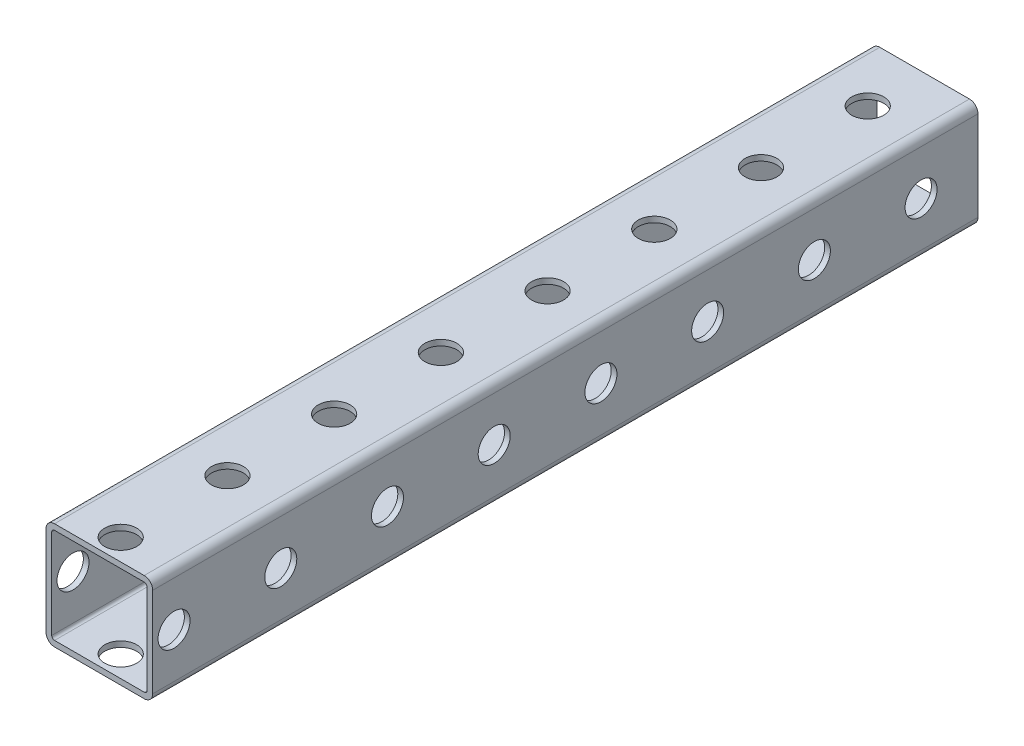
ISO-10303-21;
HEADER;
FILE_DESCRIPTION(('STEP AP214'),'2;1');
FILE_NAME('part.step','',(''),(''),'','','');
FILE_SCHEMA(('AUTOMOTIVE_DESIGN { 1 0 10303 214 1 1 1 1 }'));
ENDSEC;
DATA;
#1=APPLICATION_CONTEXT('core data for automotive mechanical design processes');
#2=APPLICATION_PROTOCOL_DEFINITION('international standard','automotive_design',2000,#1);
#3=PRODUCT_CONTEXT('',#1,'mechanical');
#4=PRODUCT('Part','Part','',(#3));
#5=PRODUCT_RELATED_PRODUCT_CATEGORY('part','',(#4));
#6=PRODUCT_DEFINITION_FORMATION('','',#4);
#7=PRODUCT_DEFINITION_CONTEXT('part definition',#1,'design');
#8=PRODUCT_DEFINITION('design','',#6,#7);
#9=PRODUCT_DEFINITION_SHAPE('','',#8);
#10=(LENGTH_UNIT() NAMED_UNIT(*) SI_UNIT(.MILLI.,.METRE.));
#11=(NAMED_UNIT(*) PLANE_ANGLE_UNIT() SI_UNIT($,.RADIAN.));
#12=(NAMED_UNIT(*) SI_UNIT($,.STERADIAN.) SOLID_ANGLE_UNIT());
#13=UNCERTAINTY_MEASURE_WITH_UNIT(LENGTH_MEASURE(1.E-05),#10,'distance_accuracy_value','');
#14=(GEOMETRIC_REPRESENTATION_CONTEXT(3) GLOBAL_UNCERTAINTY_ASSIGNED_CONTEXT((#13)) GLOBAL_UNIT_ASSIGNED_CONTEXT((#10,
#11,#12)) REPRESENTATION_CONTEXT('',''));
#15=CARTESIAN_POINT('',(0.,0.,0.));
#16=DIRECTION('',(0.,0.,1.));
#17=DIRECTION('',(1.,0.,0.));
#18=AXIS2_PLACEMENT_3D('',#15,#16,#17);
#19=CARTESIAN_POINT('',(20.0025,0.,358.775));
#20=DIRECTION('',(0.,1.,0.));
#21=DIRECTION('',(0.,0.,1.));
#22=AXIS2_PLACEMENT_3D('',#19,#20,#21);
#23=CYLINDRICAL_SURFACE('',#22,7.14375);
#24=CARTESIAN_POINT('',(20.0025,45.085,358.775));
#25=DIRECTION('',(0.,-1.,0.));
#26=DIRECTION('',(0.,0.,-1.));
#27=AXIS2_PLACEMENT_3D('',#24,#25,#26);
#28=CIRCLE('',#27,7.14375);
#29=CARTESIAN_POINT('',(20.0025,45.085,351.63125));
#30=VERTEX_POINT('',#29);
#31=EDGE_CURVE('E47',#30,#30,#28,.T.);
#32=ORIENTED_EDGE('',*,*,#31,.T.);
#33=EDGE_LOOP('',(#32));
#34=FACE_BOUND('',#33,.T.);
#35=CARTESIAN_POINT('',(20.0025,47.625,358.775));
#36=DIRECTION('',(0.,1.,0.));
#37=DIRECTION('',(0.,0.,1.));
#38=AXIS2_PLACEMENT_3D('',#35,#36,#37);
#39=CIRCLE('',#38,7.14375);
#40=CARTESIAN_POINT('',(20.0025,47.625,365.91875));
#41=VERTEX_POINT('',#40);
#42=EDGE_CURVE('E11',#41,#41,#39,.T.);
#43=ORIENTED_EDGE('',*,*,#42,.T.);
#44=EDGE_LOOP('',(#43));
#45=FACE_BOUND('',#44,.T.);
#46=ADVANCED_FACE('F39',(#34,#45),#23,.F.);
#47=CARTESIAN_POINT('',(20.0025,0.,311.15));
#48=DIRECTION('',(0.,1.,0.));
#49=DIRECTION('',(0.,0.,1.));
#50=AXIS2_PLACEMENT_3D('',#47,#48,#49);
#51=CYLINDRICAL_SURFACE('',#50,7.14375);
#52=CARTESIAN_POINT('',(20.0025,45.085,311.15));
#53=DIRECTION('',(0.,-1.,0.));
#54=DIRECTION('',(0.,0.,-1.));
#55=AXIS2_PLACEMENT_3D('',#52,#53,#54);
#56=CIRCLE('',#55,7.14375);
#57=CARTESIAN_POINT('',(20.0025,45.085,304.00625));
#58=VERTEX_POINT('',#57);
#59=EDGE_CURVE('E416',#58,#58,#56,.T.);
#60=ORIENTED_EDGE('',*,*,#59,.T.);
#61=EDGE_LOOP('',(#60));
#62=FACE_BOUND('',#61,.T.);
#63=CARTESIAN_POINT('',(20.0025,47.625,311.15));
#64=DIRECTION('',(0.,1.,0.));
#65=DIRECTION('',(0.,0.,1.));
#66=AXIS2_PLACEMENT_3D('',#63,#64,#65);
#67=CIRCLE('',#66,7.14375);
#68=CARTESIAN_POINT('',(20.0025,47.625,318.29375));
#69=VERTEX_POINT('',#68);
#70=EDGE_CURVE('E420',#69,#69,#67,.T.);
#71=ORIENTED_EDGE('',*,*,#70,.T.);
#72=EDGE_LOOP('',(#71));
#73=FACE_BOUND('',#72,.T.);
#74=ADVANCED_FACE('F448',(#62,#73),#51,.F.);
#75=CARTESIAN_POINT('',(20.0025,0.,263.525));
#76=DIRECTION('',(0.,1.,0.));
#77=DIRECTION('',(0.,0.,1.));
#78=AXIS2_PLACEMENT_3D('',#75,#76,#77);
#79=CYLINDRICAL_SURFACE('',#78,7.14375);
#80=CARTESIAN_POINT('',(20.0025,45.085,263.525));
#81=DIRECTION('',(0.,-1.,0.));
#82=DIRECTION('',(0.,0.,-1.));
#83=AXIS2_PLACEMENT_3D('',#80,#81,#82);
#84=CIRCLE('',#83,7.14375);
#85=CARTESIAN_POINT('',(20.0025,45.085,256.38125));
#86=VERTEX_POINT('',#85);
#87=EDGE_CURVE('E408',#86,#86,#84,.T.);
#88=ORIENTED_EDGE('',*,*,#87,.T.);
#89=EDGE_LOOP('',(#88));
#90=FACE_BOUND('',#89,.T.);
#91=CARTESIAN_POINT('',(20.0025,47.625,263.525));
#92=DIRECTION('',(0.,1.,0.));
#93=DIRECTION('',(0.,0.,1.));
#94=AXIS2_PLACEMENT_3D('',#91,#92,#93);
#95=CIRCLE('',#94,7.14375);
#96=CARTESIAN_POINT('',(20.0025,47.625,270.66875));
#97=VERTEX_POINT('',#96);
#98=EDGE_CURVE('E412',#97,#97,#95,.T.);
#99=ORIENTED_EDGE('',*,*,#98,.T.);
#100=EDGE_LOOP('',(#99));
#101=FACE_BOUND('',#100,.T.);
#102=ADVANCED_FACE('F452',(#90,#101),#79,.F.);
#103=CARTESIAN_POINT('',(20.0025,0.,215.9));
#104=DIRECTION('',(0.,1.,0.));
#105=DIRECTION('',(0.,0.,1.));
#106=AXIS2_PLACEMENT_3D('',#103,#104,#105);
#107=CYLINDRICAL_SURFACE('',#106,7.14375);
#108=CARTESIAN_POINT('',(20.0025,45.085,215.9));
#109=DIRECTION('',(0.,-1.,0.));
#110=DIRECTION('',(0.,0.,-1.));
#111=AXIS2_PLACEMENT_3D('',#108,#109,#110);
#112=CIRCLE('',#111,7.14375);
#113=CARTESIAN_POINT('',(20.0025,45.085,208.75625));
#114=VERTEX_POINT('',#113);
#115=EDGE_CURVE('E400',#114,#114,#112,.T.);
#116=ORIENTED_EDGE('',*,*,#115,.T.);
#117=EDGE_LOOP('',(#116));
#118=FACE_BOUND('',#117,.T.);
#119=CARTESIAN_POINT('',(20.0025,47.625,215.9));
#120=DIRECTION('',(0.,1.,0.));
#121=DIRECTION('',(0.,0.,1.));
#122=AXIS2_PLACEMENT_3D('',#119,#120,#121);
#123=CIRCLE('',#122,7.14375);
#124=CARTESIAN_POINT('',(20.0025,47.625,223.04375));
#125=VERTEX_POINT('',#124);
#126=EDGE_CURVE('E404',#125,#125,#123,.T.);
#127=ORIENTED_EDGE('',*,*,#126,.T.);
#128=EDGE_LOOP('',(#127));
#129=FACE_BOUND('',#128,.T.);
#130=ADVANCED_FACE('F457',(#118,#129),#107,.F.);
#131=CARTESIAN_POINT('',(20.0025,0.,168.275));
#132=DIRECTION('',(0.,1.,0.));
#133=DIRECTION('',(0.,0.,1.));
#134=AXIS2_PLACEMENT_3D('',#131,#132,#133);
#135=CYLINDRICAL_SURFACE('',#134,7.14375);
#136=CARTESIAN_POINT('',(20.0025,45.085,168.275));
#137=DIRECTION('',(0.,-1.,0.));
#138=DIRECTION('',(0.,0.,-1.));
#139=AXIS2_PLACEMENT_3D('',#136,#137,#138);
#140=CIRCLE('',#139,7.14375);
#141=CARTESIAN_POINT('',(20.0025,45.085,161.13125));
#142=VERTEX_POINT('',#141);
#143=EDGE_CURVE('E392',#142,#142,#140,.T.);
#144=ORIENTED_EDGE('',*,*,#143,.T.);
#145=EDGE_LOOP('',(#144));
#146=FACE_BOUND('',#145,.T.);
#147=CARTESIAN_POINT('',(20.0025,47.625,168.275));
#148=DIRECTION('',(0.,1.,0.));
#149=DIRECTION('',(0.,0.,1.));
#150=AXIS2_PLACEMENT_3D('',#147,#148,#149);
#151=CIRCLE('',#150,7.14375);
#152=CARTESIAN_POINT('',(20.0025,47.625,175.41875));
#153=VERTEX_POINT('',#152);
#154=EDGE_CURVE('E396',#153,#153,#151,.T.);
#155=ORIENTED_EDGE('',*,*,#154,.T.);
#156=EDGE_LOOP('',(#155));
#157=FACE_BOUND('',#156,.T.);
#158=ADVANCED_FACE('F464',(#146,#157),#135,.F.);
#159=CARTESIAN_POINT('',(20.0025,0.,120.65));
#160=DIRECTION('',(0.,1.,0.));
#161=DIRECTION('',(0.,0.,1.));
#162=AXIS2_PLACEMENT_3D('',#159,#160,#161);
#163=CYLINDRICAL_SURFACE('',#162,7.14375);
#164=CARTESIAN_POINT('',(20.0025,45.085,120.65));
#165=DIRECTION('',(0.,-1.,0.));
#166=DIRECTION('',(0.,0.,-1.));
#167=AXIS2_PLACEMENT_3D('',#164,#165,#166);
#168=CIRCLE('',#167,7.14375);
#169=CARTESIAN_POINT('',(20.0025,45.085,113.50625));
#170=VERTEX_POINT('',#169);
#171=EDGE_CURVE('E384',#170,#170,#168,.T.);
#172=ORIENTED_EDGE('',*,*,#171,.T.);
#173=EDGE_LOOP('',(#172));
#174=FACE_BOUND('',#173,.T.);
#175=CARTESIAN_POINT('',(20.0025,47.625,120.65));
#176=DIRECTION('',(0.,1.,0.));
#177=DIRECTION('',(0.,0.,1.));
#178=AXIS2_PLACEMENT_3D('',#175,#176,#177);
#179=CIRCLE('',#178,7.14375);
#180=CARTESIAN_POINT('',(20.0025,47.625,127.79375));
#181=VERTEX_POINT('',#180);
#182=EDGE_CURVE('E388',#181,#181,#179,.T.);
#183=ORIENTED_EDGE('',*,*,#182,.T.);
#184=EDGE_LOOP('',(#183));
#185=FACE_BOUND('',#184,.T.);
#186=ADVANCED_FACE('F468',(#174,#185),#163,.F.);
#187=CARTESIAN_POINT('',(-3.81000000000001,23.8125,358.775));
#188=DIRECTION('',(1.,0.,0.));
#189=DIRECTION('',(0.,0.,-1.));
#190=AXIS2_PLACEMENT_3D('',#187,#188,#189);
#191=CYLINDRICAL_SURFACE('',#190,7.14375);
#192=CARTESIAN_POINT('',(41.275,23.8125,358.775));
#193=DIRECTION('',(-1.,0.,0.));
#194=DIRECTION('',(0.,-1.,0.));
#195=AXIS2_PLACEMENT_3D('',#192,#193,#194);
#196=CIRCLE('',#195,7.14375);
#197=CARTESIAN_POINT('',(41.275,16.66875,358.775));
#198=VERTEX_POINT('',#197);
#199=EDGE_CURVE('E376',#198,#198,#196,.T.);
#200=ORIENTED_EDGE('',*,*,#199,.T.);
#201=EDGE_LOOP('',(#200));
#202=FACE_BOUND('',#201,.T.);
#203=CARTESIAN_POINT('',(43.815,23.8125,358.775));
#204=DIRECTION('',(1.,0.,0.));
#205=DIRECTION('',(0.,0.,-1.));
#206=AXIS2_PLACEMENT_3D('',#203,#204,#205);
#207=CIRCLE('',#206,7.14375);
#208=CARTESIAN_POINT('',(43.815,23.8125,351.63125));
#209=VERTEX_POINT('',#208);
#210=EDGE_CURVE('E380',#209,#209,#207,.T.);
#211=ORIENTED_EDGE('',*,*,#210,.T.);
#212=EDGE_LOOP('',(#211));
#213=FACE_BOUND('',#212,.T.);
#214=ADVANCED_FACE('F472',(#202,#213),#191,.F.);
#215=CARTESIAN_POINT('',(-3.81000000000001,23.8125,311.15));
#216=DIRECTION('',(1.,0.,0.));
#217=DIRECTION('',(0.,0.,-1.));
#218=AXIS2_PLACEMENT_3D('',#215,#216,#217);
#219=CYLINDRICAL_SURFACE('',#218,7.14375);
#220=CARTESIAN_POINT('',(41.275,23.8125,311.15));
#221=DIRECTION('',(-1.,0.,0.));
#222=DIRECTION('',(0.,-1.,0.));
#223=AXIS2_PLACEMENT_3D('',#220,#221,#222);
#224=CIRCLE('',#223,7.14375);
#225=CARTESIAN_POINT('',(41.275,16.66875,311.15));
#226=VERTEX_POINT('',#225);
#227=EDGE_CURVE('E368',#226,#226,#224,.T.);
#228=ORIENTED_EDGE('',*,*,#227,.T.);
#229=EDGE_LOOP('',(#228));
#230=FACE_BOUND('',#229,.T.);
#231=CARTESIAN_POINT('',(43.815,23.8125,311.15));
#232=DIRECTION('',(1.,0.,0.));
#233=DIRECTION('',(0.,0.,-1.));
#234=AXIS2_PLACEMENT_3D('',#231,#232,#233);
#235=CIRCLE('',#234,7.14375);
#236=CARTESIAN_POINT('',(43.815,23.8125,304.00625));
#237=VERTEX_POINT('',#236);
#238=EDGE_CURVE('E372',#237,#237,#235,.T.);
#239=ORIENTED_EDGE('',*,*,#238,.T.);
#240=EDGE_LOOP('',(#239));
#241=FACE_BOUND('',#240,.T.);
#242=ADVANCED_FACE('F476',(#230,#241),#219,.F.);
#243=CARTESIAN_POINT('',(-3.81000000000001,23.8125,263.525));
#244=DIRECTION('',(1.,0.,0.));
#245=DIRECTION('',(0.,0.,-1.));
#246=AXIS2_PLACEMENT_3D('',#243,#244,#245);
#247=CYLINDRICAL_SURFACE('',#246,7.14375);
#248=CARTESIAN_POINT('',(41.275,23.8125,263.525));
#249=DIRECTION('',(-1.,0.,0.));
#250=DIRECTION('',(0.,-1.,0.));
#251=AXIS2_PLACEMENT_3D('',#248,#249,#250);
#252=CIRCLE('',#251,7.14375);
#253=CARTESIAN_POINT('',(41.275,16.66875,263.525));
#254=VERTEX_POINT('',#253);
#255=EDGE_CURVE('E360',#254,#254,#252,.T.);
#256=ORIENTED_EDGE('',*,*,#255,.T.);
#257=EDGE_LOOP('',(#256));
#258=FACE_BOUND('',#257,.T.);
#259=CARTESIAN_POINT('',(43.815,23.8125,263.525));
#260=DIRECTION('',(1.,0.,0.));
#261=DIRECTION('',(0.,0.,-1.));
#262=AXIS2_PLACEMENT_3D('',#259,#260,#261);
#263=CIRCLE('',#262,7.14375);
#264=CARTESIAN_POINT('',(43.815,23.8125,256.38125));
#265=VERTEX_POINT('',#264);
#266=EDGE_CURVE('E364',#265,#265,#263,.T.);
#267=ORIENTED_EDGE('',*,*,#266,.T.);
#268=EDGE_LOOP('',(#267));
#269=FACE_BOUND('',#268,.T.);
#270=ADVANCED_FACE('F480',(#258,#269),#247,.F.);
#271=CARTESIAN_POINT('',(-3.81000000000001,23.8125,215.9));
#272=DIRECTION('',(1.,0.,0.));
#273=DIRECTION('',(0.,0.,-1.));
#274=AXIS2_PLACEMENT_3D('',#271,#272,#273);
#275=CYLINDRICAL_SURFACE('',#274,7.14375);
#276=CARTESIAN_POINT('',(41.275,23.8125,215.9));
#277=DIRECTION('',(-1.,0.,0.));
#278=DIRECTION('',(0.,-1.,0.));
#279=AXIS2_PLACEMENT_3D('',#276,#277,#278);
#280=CIRCLE('',#279,7.14375);
#281=CARTESIAN_POINT('',(41.275,16.66875,215.9));
#282=VERTEX_POINT('',#281);
#283=EDGE_CURVE('E352',#282,#282,#280,.T.);
#284=ORIENTED_EDGE('',*,*,#283,.T.);
#285=EDGE_LOOP('',(#284));
#286=FACE_BOUND('',#285,.T.);
#287=CARTESIAN_POINT('',(43.815,23.8125,215.9));
#288=DIRECTION('',(1.,0.,0.));
#289=DIRECTION('',(0.,0.,-1.));
#290=AXIS2_PLACEMENT_3D('',#287,#288,#289);
#291=CIRCLE('',#290,7.14375);
#292=CARTESIAN_POINT('',(43.815,23.8125,208.75625));
#293=VERTEX_POINT('',#292);
#294=EDGE_CURVE('E356',#293,#293,#291,.T.);
#295=ORIENTED_EDGE('',*,*,#294,.T.);
#296=EDGE_LOOP('',(#295));
#297=FACE_BOUND('',#296,.T.);
#298=ADVANCED_FACE('F484',(#286,#297),#275,.F.);
#299=CARTESIAN_POINT('',(-3.81000000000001,23.8125,168.275));
#300=DIRECTION('',(1.,0.,0.));
#301=DIRECTION('',(0.,0.,-1.));
#302=AXIS2_PLACEMENT_3D('',#299,#300,#301);
#303=CYLINDRICAL_SURFACE('',#302,7.14375);
#304=CARTESIAN_POINT('',(41.275,23.8125,168.275));
#305=DIRECTION('',(-1.,0.,0.));
#306=DIRECTION('',(0.,-1.,0.));
#307=AXIS2_PLACEMENT_3D('',#304,#305,#306);
#308=CIRCLE('',#307,7.14375);
#309=CARTESIAN_POINT('',(41.275,16.66875,168.275));
#310=VERTEX_POINT('',#309);
#311=EDGE_CURVE('E344',#310,#310,#308,.T.);
#312=ORIENTED_EDGE('',*,*,#311,.T.);
#313=EDGE_LOOP('',(#312));
#314=FACE_BOUND('',#313,.T.);
#315=CARTESIAN_POINT('',(43.815,23.8125,168.275));
#316=DIRECTION('',(1.,0.,0.));
#317=DIRECTION('',(0.,0.,-1.));
#318=AXIS2_PLACEMENT_3D('',#315,#316,#317);
#319=CIRCLE('',#318,7.14375);
#320=CARTESIAN_POINT('',(43.815,23.8125,161.13125));
#321=VERTEX_POINT('',#320);
#322=EDGE_CURVE('E348',#321,#321,#319,.T.);
#323=ORIENTED_EDGE('',*,*,#322,.T.);
#324=EDGE_LOOP('',(#323));
#325=FACE_BOUND('',#324,.T.);
#326=ADVANCED_FACE('F488',(#314,#325),#303,.F.);
#327=CARTESIAN_POINT('',(-3.81000000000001,23.8125,120.65));
#328=DIRECTION('',(1.,0.,0.));
#329=DIRECTION('',(0.,0.,-1.));
#330=AXIS2_PLACEMENT_3D('',#327,#328,#329);
#331=CYLINDRICAL_SURFACE('',#330,7.14375);
#332=CARTESIAN_POINT('',(41.275,23.8125,120.65));
#333=DIRECTION('',(-1.,0.,0.));
#334=DIRECTION('',(0.,-1.,0.));
#335=AXIS2_PLACEMENT_3D('',#332,#333,#334);
#336=CIRCLE('',#335,7.14375);
#337=CARTESIAN_POINT('',(41.275,16.66875,120.65));
#338=VERTEX_POINT('',#337);
#339=EDGE_CURVE('E325',#338,#338,#336,.T.);
#340=ORIENTED_EDGE('',*,*,#339,.T.);
#341=EDGE_LOOP('',(#340));
#342=FACE_BOUND('',#341,.T.);
#343=CARTESIAN_POINT('',(43.815,23.8125,120.65));
#344=DIRECTION('',(1.,0.,0.));
#345=DIRECTION('',(0.,0.,-1.));
#346=AXIS2_PLACEMENT_3D('',#343,#344,#345);
#347=CIRCLE('',#346,7.14375);
#348=CARTESIAN_POINT('',(43.815,23.8125,113.50625));
#349=VERTEX_POINT('',#348);
#350=EDGE_CURVE('E340',#349,#349,#347,.T.);
#351=ORIENTED_EDGE('',*,*,#350,.T.);
#352=EDGE_LOOP('',(#351));
#353=FACE_BOUND('',#352,.T.);
#354=ADVANCED_FACE('F492',(#342,#353),#331,.F.);
#355=CARTESIAN_POINT('',(0.,3.81,368.3));
#356=DIRECTION('',(0.,0.,1.));
#357=DIRECTION('',(1.,0.,0.));
#358=AXIS2_PLACEMENT_3D('',#355,#356,#357);
#359=PLANE('',#358);
#360=CARTESIAN_POINT('',(0.,3.81,368.3));
#361=DIRECTION('',(0.,0.,1.));
#362=DIRECTION('',(1.,0.,0.));
#363=AXIS2_PLACEMENT_3D('',#360,#361,#362);
#364=CIRCLE('',#363,3.81);
#365=CARTESIAN_POINT('',(-3.81,3.81,368.3));
#366=VERTEX_POINT('',#365);
#367=CARTESIAN_POINT('',(0.,0.,368.3));
#368=VERTEX_POINT('',#367);
#369=EDGE_CURVE('E244',#366,#368,#364,.T.);
#370=ORIENTED_EDGE('',*,*,#369,.T.);
#371=DIRECTION('',(1.,0.,0.));
#372=VECTOR('',#371,1.);
#373=CARTESIAN_POINT('',(0.,0.,368.3));
#374=LINE('',#373,#372);
#375=CARTESIAN_POINT('',(40.005,0.,368.3));
#376=VERTEX_POINT('',#375);
#377=EDGE_CURVE('E248',#368,#376,#374,.T.);
#378=ORIENTED_EDGE('',*,*,#377,.T.);
#379=CARTESIAN_POINT('',(40.005,3.81,368.3));
#380=DIRECTION('',(0.,0.,1.));
#381=DIRECTION('',(1.,0.,0.));
#382=AXIS2_PLACEMENT_3D('',#379,#380,#381);
#383=CIRCLE('',#382,3.81);
#384=CARTESIAN_POINT('',(43.815,3.81,368.3));
#385=VERTEX_POINT('',#384);
#386=EDGE_CURVE('E252',#376,#385,#383,.T.);
#387=ORIENTED_EDGE('',*,*,#386,.T.);
#388=DIRECTION('',(0.,1.,0.));
#389=VECTOR('',#388,1.);
#390=CARTESIAN_POINT('',(43.815,43.815,368.3));
#391=LINE('',#390,#389);
#392=CARTESIAN_POINT('',(43.815,43.815,368.3));
#393=VERTEX_POINT('',#392);
#394=EDGE_CURVE('E255',#385,#393,#391,.T.);
#395=ORIENTED_EDGE('',*,*,#394,.T.);
#396=CARTESIAN_POINT('',(40.005,43.815,368.3));
#397=DIRECTION('',(0.,0.,1.));
#398=DIRECTION('',(1.,0.,0.));
#399=AXIS2_PLACEMENT_3D('',#396,#397,#398);
#400=CIRCLE('',#399,3.81);
#401=CARTESIAN_POINT('',(40.005,47.625,368.3));
#402=VERTEX_POINT('',#401);
#403=EDGE_CURVE('E258',#393,#402,#400,.T.);
#404=ORIENTED_EDGE('',*,*,#403,.T.);
#405=DIRECTION('',(-1.,0.,0.));
#406=VECTOR('',#405,1.);
#407=CARTESIAN_POINT('',(0.,47.625,368.3));
#408=LINE('',#407,#406);
#409=CARTESIAN_POINT('',(0.,47.625,368.3));
#410=VERTEX_POINT('',#409);
#411=EDGE_CURVE('E261',#402,#410,#408,.T.);
#412=ORIENTED_EDGE('',*,*,#411,.T.);
#413=CARTESIAN_POINT('',(0.,43.815,368.3));
#414=DIRECTION('',(0.,0.,1.));
#415=DIRECTION('',(-1.,0.,0.));
#416=AXIS2_PLACEMENT_3D('',#413,#414,#415);
#417=CIRCLE('',#416,3.81);
#418=CARTESIAN_POINT('',(-3.81,43.815,368.3));
#419=VERTEX_POINT('',#418);
#420=EDGE_CURVE('E264',#410,#419,#417,.T.);
#421=ORIENTED_EDGE('',*,*,#420,.T.);
#422=DIRECTION('',(0.,-1.,0.));
#423=VECTOR('',#422,1.);
#424=CARTESIAN_POINT('',(-3.81,43.815,368.3));
#425=LINE('',#424,#423);
#426=EDGE_CURVE('E267',#419,#366,#425,.T.);
#427=ORIENTED_EDGE('',*,*,#426,.T.);
#428=EDGE_LOOP('',(#370,#378,#387,#395,#404,#412,#421,#427));
#429=FACE_BOUND('',#428,.T.);
#430=DIRECTION('',(0.,-1.,0.));
#431=VECTOR('',#430,1.);
#432=CARTESIAN_POINT('',(-1.27,43.815,368.3));
#433=LINE('',#432,#431);
#434=CARTESIAN_POINT('',(-1.27,43.815,368.3));
#435=VERTEX_POINT('',#434);
#436=CARTESIAN_POINT('',(-1.27,3.81,368.3));
#437=VERTEX_POINT('',#436);
#438=EDGE_CURVE('E161',#435,#437,#433,.T.);
#439=ORIENTED_EDGE('',*,*,#438,.F.);
#440=CARTESIAN_POINT('',(0.,43.815,368.3));
#441=DIRECTION('',(0.,0.,1.));
#442=DIRECTION('',(-1.,0.,0.));
#443=AXIS2_PLACEMENT_3D('',#440,#441,#442);
#444=CIRCLE('',#443,1.27);
#445=CARTESIAN_POINT('',(0.,45.085,368.3));
#446=VERTEX_POINT('',#445);
#447=EDGE_CURVE('E152',#446,#435,#444,.T.);
#448=ORIENTED_EDGE('',*,*,#447,.F.);
#449=DIRECTION('',(-1.,0.,0.));
#450=VECTOR('',#449,1.);
#451=CARTESIAN_POINT('',(0.,45.085,368.3));
#452=LINE('',#451,#450);
#453=CARTESIAN_POINT('',(40.005,45.085,368.3));
#454=VERTEX_POINT('',#453);
#455=EDGE_CURVE('E195',#454,#446,#452,.T.);
#456=ORIENTED_EDGE('',*,*,#455,.F.);
#457=CARTESIAN_POINT('',(40.005,43.815,368.3));
#458=DIRECTION('',(0.,0.,1.));
#459=DIRECTION('',(1.,0.,0.));
#460=AXIS2_PLACEMENT_3D('',#457,#458,#459);
#461=CIRCLE('',#460,1.27);
#462=CARTESIAN_POINT('',(41.275,43.815,368.3));
#463=VERTEX_POINT('',#462);
#464=EDGE_CURVE('E192',#463,#454,#461,.T.);
#465=ORIENTED_EDGE('',*,*,#464,.F.);
#466=DIRECTION('',(0.,1.,0.));
#467=VECTOR('',#466,1.);
#468=CARTESIAN_POINT('',(41.275,43.815,368.3));
#469=LINE('',#468,#467);
#470=CARTESIAN_POINT('',(41.275,3.81,368.3));
#471=VERTEX_POINT('',#470);
#472=EDGE_CURVE('E189',#471,#463,#469,.T.);
#473=ORIENTED_EDGE('',*,*,#472,.F.);
#474=CARTESIAN_POINT('',(40.005,3.81,368.3));
#475=DIRECTION('',(0.,0.,1.));
#476=DIRECTION('',(1.,0.,0.));
#477=AXIS2_PLACEMENT_3D('',#474,#475,#476);
#478=CIRCLE('',#477,1.27);
#479=CARTESIAN_POINT('',(40.005,2.54,368.3));
#480=VERTEX_POINT('',#479);
#481=EDGE_CURVE('E186',#480,#471,#478,.T.);
#482=ORIENTED_EDGE('',*,*,#481,.F.);
#483=DIRECTION('',(1.,0.,0.));
#484=VECTOR('',#483,1.);
#485=CARTESIAN_POINT('',(0.,2.54,368.3));
#486=LINE('',#485,#484);
#487=CARTESIAN_POINT('',(0.,2.54,368.3));
#488=VERTEX_POINT('',#487);
#489=EDGE_CURVE('E180',#488,#480,#486,.T.);
#490=ORIENTED_EDGE('',*,*,#489,.F.);
#491=CARTESIAN_POINT('',(0.,3.81,368.3));
#492=DIRECTION('',(0.,0.,1.));
#493=DIRECTION('',(1.,0.,0.));
#494=AXIS2_PLACEMENT_3D('',#491,#492,#493);
#495=CIRCLE('',#494,1.27);
#496=EDGE_CURVE('E176',#437,#488,#495,.T.);
#497=ORIENTED_EDGE('',*,*,#496,.F.);
#498=EDGE_LOOP('',(#439,#448,#456,#465,#473,#482,#490,#497));
#499=FACE_BOUND('',#498,.T.);
#500=ADVANCED_FACE('F174',(#429,#499),#359,.T.);
#501=CARTESIAN_POINT('',(0.,3.81,0.));
#502=DIRECTION('',(0.,0.,1.));
#503=DIRECTION('',(1.,0.,0.));
#504=AXIS2_PLACEMENT_3D('',#501,#502,#503);
#505=PLANE('',#504);
#506=CARTESIAN_POINT('',(0.,3.81,0.));
#507=DIRECTION('',(0.,0.,1.));
#508=DIRECTION('',(1.,0.,0.));
#509=AXIS2_PLACEMENT_3D('',#506,#507,#508);
#510=CIRCLE('',#509,3.81);
#511=CARTESIAN_POINT('',(-3.81,3.81,0.));
#512=VERTEX_POINT('',#511);
#513=CARTESIAN_POINT('',(0.,0.,0.));
#514=VERTEX_POINT('',#513);
#515=EDGE_CURVE('E170',#512,#514,#510,.T.);
#516=ORIENTED_EDGE('',*,*,#515,.F.);
#517=DIRECTION('',(0.,-1.,0.));
#518=VECTOR('',#517,1.);
#519=CARTESIAN_POINT('',(-3.81,43.815,0.));
#520=LINE('',#519,#518);
#521=CARTESIAN_POINT('',(-3.81,43.815,0.));
#522=VERTEX_POINT('',#521);
#523=EDGE_CURVE('E249',#522,#512,#520,.T.);
#524=ORIENTED_EDGE('',*,*,#523,.F.);
#525=CARTESIAN_POINT('',(0.,43.815,0.));
#526=DIRECTION('',(0.,0.,1.));
#527=DIRECTION('',(-1.,0.,0.));
#528=AXIS2_PLACEMENT_3D('',#525,#526,#527);
#529=CIRCLE('',#528,3.81);
#530=CARTESIAN_POINT('',(0.,47.625,0.));
#531=VERTEX_POINT('',#530);
#532=EDGE_CURVE('E289',#531,#522,#529,.T.);
#533=ORIENTED_EDGE('',*,*,#532,.F.);
#534=DIRECTION('',(-1.,0.,0.));
#535=VECTOR('',#534,1.);
#536=CARTESIAN_POINT('',(0.,47.625,0.));
#537=LINE('',#536,#535);
#538=CARTESIAN_POINT('',(40.005,47.625,0.));
#539=VERTEX_POINT('',#538);
#540=EDGE_CURVE('E286',#539,#531,#537,.T.);
#541=ORIENTED_EDGE('',*,*,#540,.F.);
#542=CARTESIAN_POINT('',(40.005,43.815,0.));
#543=DIRECTION('',(0.,0.,1.));
#544=DIRECTION('',(1.,0.,0.));
#545=AXIS2_PLACEMENT_3D('',#542,#543,#544);
#546=CIRCLE('',#545,3.81);
#547=CARTESIAN_POINT('',(43.815,43.815,0.));
#548=VERTEX_POINT('',#547);
#549=EDGE_CURVE('E283',#548,#539,#546,.T.);
#550=ORIENTED_EDGE('',*,*,#549,.F.);
#551=DIRECTION('',(0.,1.,0.));
#552=VECTOR('',#551,1.);
#553=CARTESIAN_POINT('',(43.815,43.815,0.));
#554=LINE('',#553,#552);
#555=CARTESIAN_POINT('',(43.815,3.81,0.));
#556=VERTEX_POINT('',#555);
#557=EDGE_CURVE('E280',#556,#548,#554,.T.);
#558=ORIENTED_EDGE('',*,*,#557,.F.);
#559=CARTESIAN_POINT('',(40.005,3.81,0.));
#560=DIRECTION('',(0.,0.,1.));
#561=DIRECTION('',(1.,0.,0.));
#562=AXIS2_PLACEMENT_3D('',#559,#560,#561);
#563=CIRCLE('',#562,3.81);
#564=CARTESIAN_POINT('',(40.005,0.,0.));
#565=VERTEX_POINT('',#564);
#566=EDGE_CURVE('E277',#565,#556,#563,.T.);
#567=ORIENTED_EDGE('',*,*,#566,.F.);
#568=DIRECTION('',(1.,0.,0.));
#569=VECTOR('',#568,1.);
#570=CARTESIAN_POINT('',(0.,0.,0.));
#571=LINE('',#570,#569);
#572=EDGE_CURVE('E274',#514,#565,#571,.T.);
#573=ORIENTED_EDGE('',*,*,#572,.F.);
#574=EDGE_LOOP('',(#516,#524,#533,#541,#550,#558,#567,#573));
#575=FACE_BOUND('',#574,.T.);
#576=CARTESIAN_POINT('',(0.,43.815,0.));
#577=DIRECTION('',(0.,0.,1.));
#578=DIRECTION('',(-1.,0.,0.));
#579=AXIS2_PLACEMENT_3D('',#576,#577,#578);
#580=CIRCLE('',#579,1.27);
#581=CARTESIAN_POINT('',(0.,45.085,0.));
#582=VERTEX_POINT('',#581);
#583=CARTESIAN_POINT('',(-1.27,43.815,0.));
#584=VERTEX_POINT('',#583);
#585=EDGE_CURVE('E62',#582,#584,#580,.T.);
#586=ORIENTED_EDGE('',*,*,#585,.T.);
#587=DIRECTION('',(0.,-1.,0.));
#588=VECTOR('',#587,1.);
#589=CARTESIAN_POINT('',(-1.27,43.815,0.));
#590=LINE('',#589,#588);
#591=CARTESIAN_POINT('',(-1.27,3.81,0.));
#592=VERTEX_POINT('',#591);
#593=EDGE_CURVE('E168',#584,#592,#590,.T.);
#594=ORIENTED_EDGE('',*,*,#593,.T.);
#595=CARTESIAN_POINT('',(0.,3.81,0.));
#596=DIRECTION('',(0.,0.,1.));
#597=DIRECTION('',(1.,0.,0.));
#598=AXIS2_PLACEMENT_3D('',#595,#596,#597);
#599=CIRCLE('',#598,1.27);
#600=CARTESIAN_POINT('',(0.,2.54,0.));
#601=VERTEX_POINT('',#600);
#602=EDGE_CURVE('E203',#592,#601,#599,.T.);
#603=ORIENTED_EDGE('',*,*,#602,.T.);
#604=DIRECTION('',(1.,0.,0.));
#605=VECTOR('',#604,1.);
#606=CARTESIAN_POINT('',(0.,2.54,0.));
#607=LINE('',#606,#605);
#608=CARTESIAN_POINT('',(40.005,2.54,0.));
#609=VERTEX_POINT('',#608);
#610=EDGE_CURVE('E207',#601,#609,#607,.T.);
#611=ORIENTED_EDGE('',*,*,#610,.T.);
#612=CARTESIAN_POINT('',(40.005,3.81,0.));
#613=DIRECTION('',(0.,0.,1.));
#614=DIRECTION('',(1.,0.,0.));
#615=AXIS2_PLACEMENT_3D('',#612,#613,#614);
#616=CIRCLE('',#615,1.27);
#617=CARTESIAN_POINT('',(41.275,3.81,0.));
#618=VERTEX_POINT('',#617);
#619=EDGE_CURVE('E211',#609,#618,#616,.T.);
#620=ORIENTED_EDGE('',*,*,#619,.T.);
#621=DIRECTION('',(0.,1.,0.));
#622=VECTOR('',#621,1.);
#623=CARTESIAN_POINT('',(41.275,43.815,0.));
#624=LINE('',#623,#622);
#625=CARTESIAN_POINT('',(41.275,43.815,0.));
#626=VERTEX_POINT('',#625);
#627=EDGE_CURVE('E215',#618,#626,#624,.T.);
#628=ORIENTED_EDGE('',*,*,#627,.T.);
#629=CARTESIAN_POINT('',(40.005,43.815,0.));
#630=DIRECTION('',(0.,0.,1.));
#631=DIRECTION('',(1.,0.,0.));
#632=AXIS2_PLACEMENT_3D('',#629,#630,#631);
#633=CIRCLE('',#632,1.27);
#634=CARTESIAN_POINT('',(40.005,45.085,0.));
#635=VERTEX_POINT('',#634);
#636=EDGE_CURVE('E219',#626,#635,#633,.T.);
#637=ORIENTED_EDGE('',*,*,#636,.T.);
#638=DIRECTION('',(-1.,0.,0.));
#639=VECTOR('',#638,1.);
#640=CARTESIAN_POINT('',(0.,45.085,0.));
#641=LINE('',#640,#639);
#642=EDGE_CURVE('E162',#635,#582,#641,.T.);
#643=ORIENTED_EDGE('',*,*,#642,.T.);
#644=EDGE_LOOP('',(#586,#594,#603,#611,#620,#628,#637,#643));
#645=FACE_BOUND('',#644,.T.);
#646=ADVANCED_FACE('F501',(#575,#645),#505,.F.);
#647=CARTESIAN_POINT('',(0.,3.81,368.3));
#648=DIRECTION('',(0.,0.,-1.));
#649=DIRECTION('',(-1.,0.,0.));
#650=AXIS2_PLACEMENT_3D('',#647,#648,#649);
#651=CYLINDRICAL_SURFACE('',#650,3.81);
#652=ORIENTED_EDGE('',*,*,#515,.T.);
#653=DIRECTION('',(0.,0.,-1.));
#654=VECTOR('',#653,1.);
#655=CARTESIAN_POINT('',(0.,0.,368.3));
#656=LINE('',#655,#654);
#657=EDGE_CURVE('E321',#368,#514,#656,.T.);
#658=ORIENTED_EDGE('',*,*,#657,.F.);
#659=ORIENTED_EDGE('',*,*,#369,.F.);
#660=DIRECTION('',(0.,0.,-1.));
#661=VECTOR('',#660,1.);
#662=CARTESIAN_POINT('',(-3.81,3.81,368.3));
#663=LINE('',#662,#661);
#664=EDGE_CURVE('E270',#366,#512,#663,.T.);
#665=ORIENTED_EDGE('',*,*,#664,.T.);
#666=EDGE_LOOP('',(#652,#658,#659,#665));
#667=FACE_BOUND('',#666,.T.);
#668=ADVANCED_FACE('F497',(#667),#651,.T.);
#669=CARTESIAN_POINT('',(0.,0.,368.3));
#670=DIRECTION('',(0.,1.,0.));
#671=DIRECTION('',(0.,0.,1.));
#672=AXIS2_PLACEMENT_3D('',#669,#670,#671);
#673=PLANE('',#672);
#674=CARTESIAN_POINT('',(20.0025,0.,120.65));
#675=DIRECTION('',(0.,1.,0.));
#676=DIRECTION('',(0.,0.,1.));
#677=AXIS2_PLACEMENT_3D('',#674,#675,#676);
#678=CIRCLE('',#677,7.14375);
#679=CARTESIAN_POINT('',(20.0025,0.,127.79375));
#680=VERTEX_POINT('',#679);
#681=EDGE_CURVE('E760',#680,#680,#678,.T.);
#682=ORIENTED_EDGE('',*,*,#681,.T.);
#683=EDGE_LOOP('',(#682));
#684=FACE_BOUND('',#683,.T.);
#685=CARTESIAN_POINT('',(20.0025,0.,168.275));
#686=DIRECTION('',(0.,1.,0.));
#687=DIRECTION('',(0.,0.,1.));
#688=AXIS2_PLACEMENT_3D('',#685,#686,#687);
#689=CIRCLE('',#688,7.14375);
#690=CARTESIAN_POINT('',(20.0025,0.,175.41875));
#691=VERTEX_POINT('',#690);
#692=EDGE_CURVE('E769',#691,#691,#689,.T.);
#693=ORIENTED_EDGE('',*,*,#692,.T.);
#694=EDGE_LOOP('',(#693));
#695=FACE_BOUND('',#694,.T.);
#696=CARTESIAN_POINT('',(20.0025,0.,215.9));
#697=DIRECTION('',(0.,1.,0.));
#698=DIRECTION('',(0.,0.,1.));
#699=AXIS2_PLACEMENT_3D('',#696,#697,#698);
#700=CIRCLE('',#699,7.14375);
#701=CARTESIAN_POINT('',(20.0025,0.,223.04375));
#702=VERTEX_POINT('',#701);
#703=EDGE_CURVE('E776',#702,#702,#700,.T.);
#704=ORIENTED_EDGE('',*,*,#703,.T.);
#705=EDGE_LOOP('',(#704));
#706=FACE_BOUND('',#705,.T.);
#707=CARTESIAN_POINT('',(20.0025,0.,263.525));
#708=DIRECTION('',(0.,1.,0.));
#709=DIRECTION('',(0.,0.,1.));
#710=AXIS2_PLACEMENT_3D('',#707,#708,#709);
#711=CIRCLE('',#710,7.14375);
#712=CARTESIAN_POINT('',(20.0025,0.,270.66875));
#713=VERTEX_POINT('',#712);
#714=EDGE_CURVE('E784',#713,#713,#711,.T.);
#715=ORIENTED_EDGE('',*,*,#714,.T.);
#716=EDGE_LOOP('',(#715));
#717=FACE_BOUND('',#716,.T.);
#718=CARTESIAN_POINT('',(20.0025,0.,311.15));
#719=DIRECTION('',(0.,1.,0.));
#720=DIRECTION('',(0.,0.,1.));
#721=AXIS2_PLACEMENT_3D('',#718,#719,#720);
#722=CIRCLE('',#721,7.14375);
#723=CARTESIAN_POINT('',(20.0025,0.,318.29375));
#724=VERTEX_POINT('',#723);
#725=EDGE_CURVE('E792',#724,#724,#722,.T.);
#726=ORIENTED_EDGE('',*,*,#725,.T.);
#727=EDGE_LOOP('',(#726));
#728=FACE_BOUND('',#727,.T.);
#729=CARTESIAN_POINT('',(20.0025,0.,358.775));
#730=DIRECTION('',(0.,1.,0.));
#731=DIRECTION('',(0.,0.,1.));
#732=AXIS2_PLACEMENT_3D('',#729,#730,#731);
#733=CIRCLE('',#732,7.14375);
#734=CARTESIAN_POINT('',(20.0025,0.,365.91875));
#735=VERTEX_POINT('',#734);
#736=EDGE_CURVE('E800',#735,#735,#733,.T.);
#737=ORIENTED_EDGE('',*,*,#736,.T.);
#738=EDGE_LOOP('',(#737));
#739=FACE_BOUND('',#738,.T.);
#740=CARTESIAN_POINT('',(20.0025,0.,73.025));
#741=DIRECTION('',(0.,1.,0.));
#742=DIRECTION('',(0.,0.,1.));
#743=AXIS2_PLACEMENT_3D('',#740,#741,#742);
#744=CIRCLE('',#743,7.14375);
#745=CARTESIAN_POINT('',(20.0025,0.,80.16875));
#746=VERTEX_POINT('',#745);
#747=EDGE_CURVE('E767',#746,#746,#744,.T.);
#748=ORIENTED_EDGE('',*,*,#747,.T.);
#749=EDGE_LOOP('',(#748));
#750=FACE_BOUND('',#749,.T.);
#751=CARTESIAN_POINT('',(20.0025,0.,25.4));
#752=DIRECTION('',(0.,1.,0.));
#753=DIRECTION('',(0.,0.,1.));
#754=AXIS2_PLACEMENT_3D('',#751,#752,#753);
#755=CIRCLE('',#754,7.14375);
#756=CARTESIAN_POINT('',(20.0025,0.,32.54375));
#757=VERTEX_POINT('',#756);
#758=EDGE_CURVE('E336',#757,#757,#755,.T.);
#759=ORIENTED_EDGE('',*,*,#758,.T.);
#760=EDGE_LOOP('',(#759));
#761=FACE_BOUND('',#760,.T.);
#762=ORIENTED_EDGE('',*,*,#572,.T.);
#763=DIRECTION('',(0.,0.,-1.));
#764=VECTOR('',#763,1.);
#765=CARTESIAN_POINT('',(40.005,0.,368.3));
#766=LINE('',#765,#764);
#767=EDGE_CURVE('E317',#376,#565,#766,.T.);
#768=ORIENTED_EDGE('',*,*,#767,.F.);
#769=ORIENTED_EDGE('',*,*,#377,.F.);
#770=ORIENTED_EDGE('',*,*,#657,.T.);
#771=EDGE_LOOP('',(#762,#768,#769,#770));
#772=FACE_BOUND('',#771,.T.);
#773=ADVANCED_FACE('F500',(#684,#695,#706,#717,#728,#739,#750,#761,#772),#673,.F.);
#774=CARTESIAN_POINT('',(40.005,3.81,368.3));
#775=DIRECTION('',(0.,0.,-1.));
#776=DIRECTION('',(-1.,0.,0.));
#777=AXIS2_PLACEMENT_3D('',#774,#775,#776);
#778=CYLINDRICAL_SURFACE('',#777,3.81);
#779=ORIENTED_EDGE('',*,*,#566,.T.);
#780=DIRECTION('',(0.,0.,-1.));
#781=VECTOR('',#780,1.);
#782=CARTESIAN_POINT('',(43.815,3.81,368.3));
#783=LINE('',#782,#781);
#784=EDGE_CURVE('E313',#385,#556,#783,.T.);
#785=ORIENTED_EDGE('',*,*,#784,.F.);
#786=ORIENTED_EDGE('',*,*,#386,.F.);
#787=ORIENTED_EDGE('',*,*,#767,.T.);
#788=EDGE_LOOP('',(#779,#785,#786,#787));
#789=FACE_BOUND('',#788,.T.);
#790=ADVANCED_FACE('F505',(#789),#778,.T.);
#791=CARTESIAN_POINT('',(43.815,43.815,368.3));
#792=DIRECTION('',(-1.,0.,0.));
#793=DIRECTION('',(0.,0.,1.));
#794=AXIS2_PLACEMENT_3D('',#791,#792,#793);
#795=PLANE('',#794);
#796=CARTESIAN_POINT('',(43.815,23.8125,73.025));
#797=DIRECTION('',(1.,0.,0.));
#798=DIRECTION('',(0.,0.,-1.));
#799=AXIS2_PLACEMENT_3D('',#796,#797,#798);
#800=CIRCLE('',#799,7.14375);
#801=CARTESIAN_POINT('',(43.815,23.8125,65.88125));
#802=VERTEX_POINT('',#801);
#803=EDGE_CURVE('E880',#802,#802,#800,.T.);
#804=ORIENTED_EDGE('',*,*,#803,.F.);
#805=EDGE_LOOP('',(#804));
#806=FACE_BOUND('',#805,.T.);
#807=CARTESIAN_POINT('',(43.815,23.8125,25.4));
#808=DIRECTION('',(1.,0.,0.));
#809=DIRECTION('',(0.,0.,-1.));
#810=AXIS2_PLACEMENT_3D('',#807,#808,#809);
#811=CIRCLE('',#810,7.14375);
#812=CARTESIAN_POINT('',(43.815,23.8125,18.25625));
#813=VERTEX_POINT('',#812);
#814=EDGE_CURVE('E636',#813,#813,#811,.T.);
#815=ORIENTED_EDGE('',*,*,#814,.F.);
#816=EDGE_LOOP('',(#815));
#817=FACE_BOUND('',#816,.T.);
#818=ORIENTED_EDGE('',*,*,#557,.T.);
#819=DIRECTION('',(0.,0.,-1.));
#820=VECTOR('',#819,1.);
#821=CARTESIAN_POINT('',(43.815,43.815,368.3));
#822=LINE('',#821,#820);
#823=EDGE_CURVE('E309',#393,#548,#822,.T.);
#824=ORIENTED_EDGE('',*,*,#823,.F.);
#825=ORIENTED_EDGE('',*,*,#394,.F.);
#826=ORIENTED_EDGE('',*,*,#784,.T.);
#827=EDGE_LOOP('',(#818,#824,#825,#826));
#828=FACE_BOUND('',#827,.T.);
#829=ORIENTED_EDGE('',*,*,#350,.F.);
#830=EDGE_LOOP('',(#829));
#831=FACE_BOUND('',#830,.T.);
#832=ORIENTED_EDGE('',*,*,#322,.F.);
#833=EDGE_LOOP('',(#832));
#834=FACE_BOUND('',#833,.T.);
#835=ORIENTED_EDGE('',*,*,#294,.F.);
#836=EDGE_LOOP('',(#835));
#837=FACE_BOUND('',#836,.T.);
#838=ORIENTED_EDGE('',*,*,#266,.F.);
#839=EDGE_LOOP('',(#838));
#840=FACE_BOUND('',#839,.T.);
#841=ORIENTED_EDGE('',*,*,#238,.F.);
#842=EDGE_LOOP('',(#841));
#843=FACE_BOUND('',#842,.T.);
#844=ORIENTED_EDGE('',*,*,#210,.F.);
#845=EDGE_LOOP('',(#844));
#846=FACE_BOUND('',#845,.T.);
#847=ADVANCED_FACE('F509',(#806,#817,#828,#831,#834,#837,#840,#843,#846),#795,.F.);
#848=CARTESIAN_POINT('',(40.005,43.815,368.3));
#849=DIRECTION('',(0.,0.,-1.));
#850=DIRECTION('',(-1.,0.,0.));
#851=AXIS2_PLACEMENT_3D('',#848,#849,#850);
#852=CYLINDRICAL_SURFACE('',#851,3.81);
#853=ORIENTED_EDGE('',*,*,#549,.T.);
#854=DIRECTION('',(0.,0.,-1.));
#855=VECTOR('',#854,1.);
#856=CARTESIAN_POINT('',(40.005,47.625,368.3));
#857=LINE('',#856,#855);
#858=EDGE_CURVE('E305',#402,#539,#857,.T.);
#859=ORIENTED_EDGE('',*,*,#858,.F.);
#860=ORIENTED_EDGE('',*,*,#403,.F.);
#861=ORIENTED_EDGE('',*,*,#823,.T.);
#862=EDGE_LOOP('',(#853,#859,#860,#861));
#863=FACE_BOUND('',#862,.T.);
#864=ADVANCED_FACE('F513',(#863),#852,.T.);
#865=CARTESIAN_POINT('',(0.,47.625,368.3));
#866=DIRECTION('',(0.,-1.,0.));
#867=DIRECTION('',(0.,0.,-1.));
#868=AXIS2_PLACEMENT_3D('',#865,#866,#867);
#869=PLANE('',#868);
#870=CARTESIAN_POINT('',(20.0025,47.625,73.025));
#871=DIRECTION('',(0.,1.,0.));
#872=DIRECTION('',(0.,0.,1.));
#873=AXIS2_PLACEMENT_3D('',#870,#871,#872);
#874=CIRCLE('',#873,7.14375);
#875=CARTESIAN_POINT('',(20.0025,47.625,80.16875));
#876=VERTEX_POINT('',#875);
#877=EDGE_CURVE('E818',#876,#876,#874,.T.);
#878=ORIENTED_EDGE('',*,*,#877,.F.);
#879=EDGE_LOOP('',(#878));
#880=FACE_BOUND('',#879,.T.);
#881=CARTESIAN_POINT('',(20.0025,47.625,25.4));
#882=DIRECTION('',(0.,1.,0.));
#883=DIRECTION('',(0.,0.,1.));
#884=AXIS2_PLACEMENT_3D('',#881,#882,#883);
#885=CIRCLE('',#884,7.14375);
#886=CARTESIAN_POINT('',(20.0025,47.625,32.54375));
#887=VERTEX_POINT('',#886);
#888=EDGE_CURVE('E884',#887,#887,#885,.T.);
#889=ORIENTED_EDGE('',*,*,#888,.F.);
#890=EDGE_LOOP('',(#889));
#891=FACE_BOUND('',#890,.T.);
#892=ORIENTED_EDGE('',*,*,#540,.T.);
#893=DIRECTION('',(0.,0.,-1.));
#894=VECTOR('',#893,1.);
#895=CARTESIAN_POINT('',(0.,47.625,368.3));
#896=LINE('',#895,#894);
#897=EDGE_CURVE('E301',#410,#531,#896,.T.);
#898=ORIENTED_EDGE('',*,*,#897,.F.);
#899=ORIENTED_EDGE('',*,*,#411,.F.);
#900=ORIENTED_EDGE('',*,*,#858,.T.);
#901=EDGE_LOOP('',(#892,#898,#899,#900));
#902=FACE_BOUND('',#901,.T.);
#903=ORIENTED_EDGE('',*,*,#182,.F.);
#904=EDGE_LOOP('',(#903));
#905=FACE_BOUND('',#904,.T.);
#906=ORIENTED_EDGE('',*,*,#154,.F.);
#907=EDGE_LOOP('',(#906));
#908=FACE_BOUND('',#907,.T.);
#909=ORIENTED_EDGE('',*,*,#126,.F.);
#910=EDGE_LOOP('',(#909));
#911=FACE_BOUND('',#910,.T.);
#912=ORIENTED_EDGE('',*,*,#98,.F.);
#913=EDGE_LOOP('',(#912));
#914=FACE_BOUND('',#913,.T.);
#915=ORIENTED_EDGE('',*,*,#70,.F.);
#916=EDGE_LOOP('',(#915));
#917=FACE_BOUND('',#916,.T.);
#918=ORIENTED_EDGE('',*,*,#42,.F.);
#919=EDGE_LOOP('',(#918));
#920=FACE_BOUND('',#919,.T.);
#921=ADVANCED_FACE('F517',(#880,#891,#902,#905,#908,#911,#914,#917,#920),#869,.F.);
#922=CARTESIAN_POINT('',(0.,43.815,368.3));
#923=DIRECTION('',(0.,0.,-1.));
#924=DIRECTION('',(-1.,0.,0.));
#925=AXIS2_PLACEMENT_3D('',#922,#923,#924);
#926=CYLINDRICAL_SURFACE('',#925,3.81);
#927=ORIENTED_EDGE('',*,*,#532,.T.);
#928=DIRECTION('',(0.,0.,-1.));
#929=VECTOR('',#928,1.);
#930=CARTESIAN_POINT('',(-3.81,43.815,368.3));
#931=LINE('',#930,#929);
#932=EDGE_CURVE('E297',#419,#522,#931,.T.);
#933=ORIENTED_EDGE('',*,*,#932,.F.);
#934=ORIENTED_EDGE('',*,*,#420,.F.);
#935=ORIENTED_EDGE('',*,*,#897,.T.);
#936=EDGE_LOOP('',(#927,#933,#934,#935));
#937=FACE_BOUND('',#936,.T.);
#938=ADVANCED_FACE('F521',(#937),#926,.T.);
#939=CARTESIAN_POINT('',(-3.81,43.815,368.3));
#940=DIRECTION('',(1.,0.,0.));
#941=DIRECTION('',(0.,1.,0.));
#942=AXIS2_PLACEMENT_3D('',#939,#940,#941);
#943=PLANE('',#942);
#944=CARTESIAN_POINT('',(-3.81000000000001,23.8125,120.65));
#945=DIRECTION('',(1.,0.,0.));
#946=DIRECTION('',(0.,0.,-1.));
#947=AXIS2_PLACEMENT_3D('',#944,#945,#946);
#948=CIRCLE('',#947,7.14375);
#949=CARTESIAN_POINT('',(-3.81000000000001,23.8125,113.50625));
#950=VERTEX_POINT('',#949);
#951=EDGE_CURVE('E827',#950,#950,#948,.T.);
#952=ORIENTED_EDGE('',*,*,#951,.T.);
#953=EDGE_LOOP('',(#952));
#954=FACE_BOUND('',#953,.T.);
#955=CARTESIAN_POINT('',(-3.81000000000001,23.8125,168.275));
#956=DIRECTION('',(1.,0.,0.));
#957=DIRECTION('',(0.,0.,-1.));
#958=AXIS2_PLACEMENT_3D('',#955,#956,#957);
#959=CIRCLE('',#958,7.14375);
#960=CARTESIAN_POINT('',(-3.81000000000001,23.8125,161.13125));
#961=VERTEX_POINT('',#960);
#962=EDGE_CURVE('E828',#961,#961,#959,.T.);
#963=ORIENTED_EDGE('',*,*,#962,.T.);
#964=EDGE_LOOP('',(#963));
#965=FACE_BOUND('',#964,.T.);
#966=CARTESIAN_POINT('',(-3.81000000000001,23.8125,215.9));
#967=DIRECTION('',(1.,0.,0.));
#968=DIRECTION('',(0.,0.,-1.));
#969=AXIS2_PLACEMENT_3D('',#966,#967,#968);
#970=CIRCLE('',#969,7.14375);
#971=CARTESIAN_POINT('',(-3.81000000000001,23.8125,208.75625));
#972=VERTEX_POINT('',#971);
#973=EDGE_CURVE('E837',#972,#972,#970,.T.);
#974=ORIENTED_EDGE('',*,*,#973,.T.);
#975=EDGE_LOOP('',(#974));
#976=FACE_BOUND('',#975,.T.);
#977=CARTESIAN_POINT('',(-3.81000000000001,23.8125,263.525));
#978=DIRECTION('',(1.,0.,0.));
#979=DIRECTION('',(0.,0.,-1.));
#980=AXIS2_PLACEMENT_3D('',#977,#978,#979);
#981=CIRCLE('',#980,7.14375);
#982=CARTESIAN_POINT('',(-3.81000000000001,23.8125,256.38125));
#983=VERTEX_POINT('',#982);
#984=EDGE_CURVE('E845',#983,#983,#981,.T.);
#985=ORIENTED_EDGE('',*,*,#984,.T.);
#986=EDGE_LOOP('',(#985));
#987=FACE_BOUND('',#986,.T.);
#988=CARTESIAN_POINT('',(-3.81000000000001,23.8125,311.15));
#989=DIRECTION('',(1.,0.,0.));
#990=DIRECTION('',(0.,0.,-1.));
#991=AXIS2_PLACEMENT_3D('',#988,#989,#990);
#992=CIRCLE('',#991,7.14375);
#993=CARTESIAN_POINT('',(-3.81000000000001,23.8125,304.00625));
#994=VERTEX_POINT('',#993);
#995=EDGE_CURVE('E853',#994,#994,#992,.T.);
#996=ORIENTED_EDGE('',*,*,#995,.T.);
#997=EDGE_LOOP('',(#996));
#998=FACE_BOUND('',#997,.T.);
#999=CARTESIAN_POINT('',(-3.81000000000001,23.8125,358.775));
#1000=DIRECTION('',(1.,0.,0.));
#1001=DIRECTION('',(0.,0.,-1.));
#1002=AXIS2_PLACEMENT_3D('',#999,#1000,#1001);
#1003=CIRCLE('',#1002,7.14375);
#1004=CARTESIAN_POINT('',(-3.81000000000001,23.8125,351.63125));
#1005=VERTEX_POINT('',#1004);
#1006=EDGE_CURVE('E861',#1005,#1005,#1003,.T.);
#1007=ORIENTED_EDGE('',*,*,#1006,.T.);
#1008=EDGE_LOOP('',(#1007));
#1009=FACE_BOUND('',#1008,.T.);
#1010=CARTESIAN_POINT('',(-3.81000000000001,23.8125,73.025));
#1011=DIRECTION('',(1.,0.,0.));
#1012=DIRECTION('',(0.,0.,-1.));
#1013=AXIS2_PLACEMENT_3D('',#1010,#1011,#1012);
#1014=CIRCLE('',#1013,7.14375);
#1015=CARTESIAN_POINT('',(-3.81000000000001,23.8125,65.88125));
#1016=VERTEX_POINT('',#1015);
#1017=EDGE_CURVE('E874',#1016,#1016,#1014,.T.);
#1018=ORIENTED_EDGE('',*,*,#1017,.T.);
#1019=EDGE_LOOP('',(#1018));
#1020=FACE_BOUND('',#1019,.T.);
#1021=CARTESIAN_POINT('',(-3.81000000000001,23.8125,25.4));
#1022=DIRECTION('',(1.,0.,0.));
#1023=DIRECTION('',(0.,0.,-1.));
#1024=AXIS2_PLACEMENT_3D('',#1021,#1022,#1023);
#1025=CIRCLE('',#1024,7.14375);
#1026=CARTESIAN_POINT('',(-3.81000000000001,23.8125,18.25625));
#1027=VERTEX_POINT('',#1026);
#1028=EDGE_CURVE('E330',#1027,#1027,#1025,.T.);
#1029=ORIENTED_EDGE('',*,*,#1028,.T.);
#1030=EDGE_LOOP('',(#1029));
#1031=FACE_BOUND('',#1030,.T.);
#1032=ORIENTED_EDGE('',*,*,#523,.T.);
#1033=ORIENTED_EDGE('',*,*,#664,.F.);
#1034=ORIENTED_EDGE('',*,*,#426,.F.);
#1035=ORIENTED_EDGE('',*,*,#932,.T.);
#1036=EDGE_LOOP('',(#1032,#1033,#1034,#1035));
#1037=FACE_BOUND('',#1036,.T.);
#1038=ADVANCED_FACE('F525',(#954,#965,#976,#987,#998,#1009,#1020,#1031,#1037),#943,.F.);
#1039=CARTESIAN_POINT('',(0.,43.815,368.3));
#1040=DIRECTION('',(0.,0.,-1.));
#1041=DIRECTION('',(-1.,0.,0.));
#1042=AXIS2_PLACEMENT_3D('',#1039,#1040,#1041);
#1043=CYLINDRICAL_SURFACE('',#1042,1.27);
#1044=ORIENTED_EDGE('',*,*,#585,.F.);
#1045=DIRECTION('',(0.,0.,-1.));
#1046=VECTOR('',#1045,1.);
#1047=CARTESIAN_POINT('',(0.,45.085,368.3));
#1048=LINE('',#1047,#1046);
#1049=EDGE_CURVE('E156',#446,#582,#1048,.T.);
#1050=ORIENTED_EDGE('',*,*,#1049,.F.);
#1051=ORIENTED_EDGE('',*,*,#447,.T.);
#1052=DIRECTION('',(0.,0.,-1.));
#1053=VECTOR('',#1052,1.);
#1054=CARTESIAN_POINT('',(-1.27,43.815,368.3));
#1055=LINE('',#1054,#1053);
#1056=EDGE_CURVE('E155',#435,#584,#1055,.T.);
#1057=ORIENTED_EDGE('',*,*,#1056,.T.);
#1058=EDGE_LOOP('',(#1044,#1050,#1051,#1057));
#1059=FACE_BOUND('',#1058,.T.);
#1060=ADVANCED_FACE('F154',(#1059),#1043,.F.);
#1061=CARTESIAN_POINT('',(-1.27,43.815,368.3));
#1062=DIRECTION('',(1.,0.,0.));
#1063=DIRECTION('',(0.,1.,0.));
#1064=AXIS2_PLACEMENT_3D('',#1061,#1062,#1063);
#1065=PLANE('',#1064);
#1066=CARTESIAN_POINT('',(-1.27,23.8125,120.65));
#1067=DIRECTION('',(1.,0.,0.));
#1068=DIRECTION('',(0.,1.,0.));
#1069=AXIS2_PLACEMENT_3D('',#1066,#1067,#1068);
#1070=CIRCLE('',#1069,7.14375);
#1071=CARTESIAN_POINT('',(-1.27,30.95625,120.65));
#1072=VERTEX_POINT('',#1071);
#1073=EDGE_CURVE('E823',#1072,#1072,#1070,.T.);
#1074=ORIENTED_EDGE('',*,*,#1073,.F.);
#1075=EDGE_LOOP('',(#1074));
#1076=FACE_BOUND('',#1075,.T.);
#1077=CARTESIAN_POINT('',(-1.27,23.8125,168.275));
#1078=DIRECTION('',(1.,0.,0.));
#1079=DIRECTION('',(0.,1.,0.));
#1080=AXIS2_PLACEMENT_3D('',#1077,#1078,#1079);
#1081=CIRCLE('',#1080,7.14375);
#1082=CARTESIAN_POINT('',(-1.27,30.95625,168.275));
#1083=VERTEX_POINT('',#1082);
#1084=EDGE_CURVE('E833',#1083,#1083,#1081,.T.);
#1085=ORIENTED_EDGE('',*,*,#1084,.F.);
#1086=EDGE_LOOP('',(#1085));
#1087=FACE_BOUND('',#1086,.T.);
#1088=CARTESIAN_POINT('',(-1.27,23.8125,215.9));
#1089=DIRECTION('',(1.,0.,0.));
#1090=DIRECTION('',(0.,1.,0.));
#1091=AXIS2_PLACEMENT_3D('',#1088,#1089,#1090);
#1092=CIRCLE('',#1091,7.14375);
#1093=CARTESIAN_POINT('',(-1.27,30.95625,215.9));
#1094=VERTEX_POINT('',#1093);
#1095=EDGE_CURVE('E841',#1094,#1094,#1092,.T.);
#1096=ORIENTED_EDGE('',*,*,#1095,.F.);
#1097=EDGE_LOOP('',(#1096));
#1098=FACE_BOUND('',#1097,.T.);
#1099=CARTESIAN_POINT('',(-1.27,23.8125,263.525));
#1100=DIRECTION('',(1.,0.,0.));
#1101=DIRECTION('',(0.,1.,0.));
#1102=AXIS2_PLACEMENT_3D('',#1099,#1100,#1101);
#1103=CIRCLE('',#1102,7.14375);
#1104=CARTESIAN_POINT('',(-1.27,30.95625,263.525));
#1105=VERTEX_POINT('',#1104);
#1106=EDGE_CURVE('E849',#1105,#1105,#1103,.T.);
#1107=ORIENTED_EDGE('',*,*,#1106,.F.);
#1108=EDGE_LOOP('',(#1107));
#1109=FACE_BOUND('',#1108,.T.);
#1110=CARTESIAN_POINT('',(-1.27,23.8125,311.15));
#1111=DIRECTION('',(1.,0.,0.));
#1112=DIRECTION('',(0.,1.,0.));
#1113=AXIS2_PLACEMENT_3D('',#1110,#1111,#1112);
#1114=CIRCLE('',#1113,7.14375);
#1115=CARTESIAN_POINT('',(-1.27,30.95625,311.15));
#1116=VERTEX_POINT('',#1115);
#1117=EDGE_CURVE('E857',#1116,#1116,#1114,.T.);
#1118=ORIENTED_EDGE('',*,*,#1117,.F.);
#1119=EDGE_LOOP('',(#1118));
#1120=FACE_BOUND('',#1119,.T.);
#1121=CARTESIAN_POINT('',(-1.27,23.8125,358.775));
#1122=DIRECTION('',(1.,0.,0.));
#1123=DIRECTION('',(0.,1.,0.));
#1124=AXIS2_PLACEMENT_3D('',#1121,#1122,#1123);
#1125=CIRCLE('',#1124,7.14375);
#1126=CARTESIAN_POINT('',(-1.27,30.95625,358.775));
#1127=VERTEX_POINT('',#1126);
#1128=EDGE_CURVE('E822',#1127,#1127,#1125,.T.);
#1129=ORIENTED_EDGE('',*,*,#1128,.F.);
#1130=EDGE_LOOP('',(#1129));
#1131=FACE_BOUND('',#1130,.T.);
#1132=CARTESIAN_POINT('',(-1.27,23.8125,73.025));
#1133=DIRECTION('',(1.,0.,0.));
#1134=DIRECTION('',(0.,1.,0.));
#1135=AXIS2_PLACEMENT_3D('',#1132,#1133,#1134);
#1136=CIRCLE('',#1135,7.14375);
#1137=CARTESIAN_POINT('',(-1.27,30.95625,73.025));
#1138=VERTEX_POINT('',#1137);
#1139=EDGE_CURVE('E832',#1138,#1138,#1136,.T.);
#1140=ORIENTED_EDGE('',*,*,#1139,.F.);
#1141=EDGE_LOOP('',(#1140));
#1142=FACE_BOUND('',#1141,.T.);
#1143=CARTESIAN_POINT('',(-1.27,23.8125,25.4));
#1144=DIRECTION('',(1.,0.,0.));
#1145=DIRECTION('',(0.,1.,0.));
#1146=AXIS2_PLACEMENT_3D('',#1143,#1144,#1145);
#1147=CIRCLE('',#1146,7.14375);
#1148=CARTESIAN_POINT('',(-1.27,30.95625,25.4));
#1149=VERTEX_POINT('',#1148);
#1150=EDGE_CURVE('E200',#1149,#1149,#1147,.T.);
#1151=ORIENTED_EDGE('',*,*,#1150,.F.);
#1152=EDGE_LOOP('',(#1151));
#1153=FACE_BOUND('',#1152,.T.);
#1154=ORIENTED_EDGE('',*,*,#593,.F.);
#1155=ORIENTED_EDGE('',*,*,#1056,.F.);
#1156=ORIENTED_EDGE('',*,*,#438,.T.);
#1157=DIRECTION('',(0.,0.,-1.));
#1158=VECTOR('',#1157,1.);
#1159=CARTESIAN_POINT('',(-1.27,3.81,368.3));
#1160=LINE('',#1159,#1158);
#1161=EDGE_CURVE('E171',#437,#592,#1160,.T.);
#1162=ORIENTED_EDGE('',*,*,#1161,.T.);
#1163=EDGE_LOOP('',(#1154,#1155,#1156,#1162));
#1164=FACE_BOUND('',#1163,.T.);
#1165=ADVANCED_FACE('F165',(#1076,#1087,#1098,#1109,#1120,#1131,#1142,#1153,#1164),#1065,.T.);
#1166=CARTESIAN_POINT('',(0.,3.81,368.3));
#1167=DIRECTION('',(0.,0.,-1.));
#1168=DIRECTION('',(-1.,0.,0.));
#1169=AXIS2_PLACEMENT_3D('',#1166,#1167,#1168);
#1170=CYLINDRICAL_SURFACE('',#1169,1.27);
#1171=ORIENTED_EDGE('',*,*,#602,.F.);
#1172=ORIENTED_EDGE('',*,*,#1161,.F.);
#1173=ORIENTED_EDGE('',*,*,#496,.T.);
#1174=DIRECTION('',(0.,0.,-1.));
#1175=VECTOR('',#1174,1.);
#1176=CARTESIAN_POINT('',(0.,2.54,368.3));
#1177=LINE('',#1176,#1175);
#1178=EDGE_CURVE('E239',#488,#601,#1177,.T.);
#1179=ORIENTED_EDGE('',*,*,#1178,.T.);
#1180=EDGE_LOOP('',(#1171,#1172,#1173,#1179));
#1181=FACE_BOUND('',#1180,.T.);
#1182=ADVANCED_FACE('F540',(#1181),#1170,.F.);
#1183=CARTESIAN_POINT('',(0.,2.54,368.3));
#1184=DIRECTION('',(0.,1.,0.));
#1185=DIRECTION('',(-1.,0.,0.));
#1186=AXIS2_PLACEMENT_3D('',#1183,#1184,#1185);
#1187=PLANE('',#1186);
#1188=CARTESIAN_POINT('',(20.0025,2.54,120.65));
#1189=DIRECTION('',(0.,1.,0.));
#1190=DIRECTION('',(-1.,0.,0.));
#1191=AXIS2_PLACEMENT_3D('',#1188,#1189,#1190);
#1192=CIRCLE('',#1191,7.14375);
#1193=CARTESIAN_POINT('',(12.85875,2.54,120.65));
#1194=VERTEX_POINT('',#1193);
#1195=EDGE_CURVE('E757',#1194,#1194,#1192,.T.);
#1196=ORIENTED_EDGE('',*,*,#1195,.F.);
#1197=EDGE_LOOP('',(#1196));
#1198=FACE_BOUND('',#1197,.T.);
#1199=CARTESIAN_POINT('',(20.0025,2.54,168.275));
#1200=DIRECTION('',(0.,1.,0.));
#1201=DIRECTION('',(-1.,0.,0.));
#1202=AXIS2_PLACEMENT_3D('',#1199,#1200,#1201);
#1203=CIRCLE('',#1202,7.14375);
#1204=CARTESIAN_POINT('',(12.85875,2.54,168.275));
#1205=VERTEX_POINT('',#1204);
#1206=EDGE_CURVE('E772',#1205,#1205,#1203,.T.);
#1207=ORIENTED_EDGE('',*,*,#1206,.F.);
#1208=EDGE_LOOP('',(#1207));
#1209=FACE_BOUND('',#1208,.T.);
#1210=CARTESIAN_POINT('',(20.0025,2.54,215.9));
#1211=DIRECTION('',(0.,1.,0.));
#1212=DIRECTION('',(-1.,0.,0.));
#1213=AXIS2_PLACEMENT_3D('',#1210,#1211,#1212);
#1214=CIRCLE('',#1213,7.14375);
#1215=CARTESIAN_POINT('',(12.85875,2.54,215.9));
#1216=VERTEX_POINT('',#1215);
#1217=EDGE_CURVE('E780',#1216,#1216,#1214,.T.);
#1218=ORIENTED_EDGE('',*,*,#1217,.F.);
#1219=EDGE_LOOP('',(#1218));
#1220=FACE_BOUND('',#1219,.T.);
#1221=CARTESIAN_POINT('',(20.0025,2.54,263.525));
#1222=DIRECTION('',(0.,1.,0.));
#1223=DIRECTION('',(-1.,0.,0.));
#1224=AXIS2_PLACEMENT_3D('',#1221,#1222,#1223);
#1225=CIRCLE('',#1224,7.14375);
#1226=CARTESIAN_POINT('',(12.85875,2.54,263.525));
#1227=VERTEX_POINT('',#1226);
#1228=EDGE_CURVE('E788',#1227,#1227,#1225,.T.);
#1229=ORIENTED_EDGE('',*,*,#1228,.F.);
#1230=EDGE_LOOP('',(#1229));
#1231=FACE_BOUND('',#1230,.T.);
#1232=CARTESIAN_POINT('',(20.0025,2.54,311.15));
#1233=DIRECTION('',(0.,1.,0.));
#1234=DIRECTION('',(-1.,0.,0.));
#1235=AXIS2_PLACEMENT_3D('',#1232,#1233,#1234);
#1236=CIRCLE('',#1235,7.14375);
#1237=CARTESIAN_POINT('',(12.85875,2.54,311.15));
#1238=VERTEX_POINT('',#1237);
#1239=EDGE_CURVE('E796',#1238,#1238,#1236,.T.);
#1240=ORIENTED_EDGE('',*,*,#1239,.F.);
#1241=EDGE_LOOP('',(#1240));
#1242=FACE_BOUND('',#1241,.T.);
#1243=CARTESIAN_POINT('',(20.0025,2.54,358.775));
#1244=DIRECTION('',(0.,1.,0.));
#1245=DIRECTION('',(-1.,0.,0.));
#1246=AXIS2_PLACEMENT_3D('',#1243,#1244,#1245);
#1247=CIRCLE('',#1246,7.14375);
#1248=CARTESIAN_POINT('',(12.85875,2.54,358.775));
#1249=VERTEX_POINT('',#1248);
#1250=EDGE_CURVE('E804',#1249,#1249,#1247,.T.);
#1251=ORIENTED_EDGE('',*,*,#1250,.F.);
#1252=EDGE_LOOP('',(#1251));
#1253=FACE_BOUND('',#1252,.T.);
#1254=CARTESIAN_POINT('',(20.0025,2.54,73.025));
#1255=DIRECTION('',(0.,1.,0.));
#1256=DIRECTION('',(-1.,0.,0.));
#1257=AXIS2_PLACEMENT_3D('',#1254,#1255,#1256);
#1258=CIRCLE('',#1257,7.14375);
#1259=CARTESIAN_POINT('',(12.85875,2.54,73.025));
#1260=VERTEX_POINT('',#1259);
#1261=EDGE_CURVE('E762',#1260,#1260,#1258,.T.);
#1262=ORIENTED_EDGE('',*,*,#1261,.F.);
#1263=EDGE_LOOP('',(#1262));
#1264=FACE_BOUND('',#1263,.T.);
#1265=CARTESIAN_POINT('',(20.0025,2.54,25.4));
#1266=DIRECTION('',(0.,1.,0.));
#1267=DIRECTION('',(-1.,0.,0.));
#1268=AXIS2_PLACEMENT_3D('',#1265,#1266,#1267);
#1269=CIRCLE('',#1268,7.14375);
#1270=CARTESIAN_POINT('',(12.85875,2.54,25.4));
#1271=VERTEX_POINT('',#1270);
#1272=EDGE_CURVE('E335',#1271,#1271,#1269,.T.);
#1273=ORIENTED_EDGE('',*,*,#1272,.F.);
#1274=EDGE_LOOP('',(#1273));
#1275=FACE_BOUND('',#1274,.T.);
#1276=ORIENTED_EDGE('',*,*,#610,.F.);
#1277=ORIENTED_EDGE('',*,*,#1178,.F.);
#1278=ORIENTED_EDGE('',*,*,#489,.T.);
#1279=DIRECTION('',(0.,0.,-1.));
#1280=VECTOR('',#1279,1.);
#1281=CARTESIAN_POINT('',(40.005,2.54,368.3));
#1282=LINE('',#1281,#1280);
#1283=EDGE_CURVE('E236',#480,#609,#1282,.T.);
#1284=ORIENTED_EDGE('',*,*,#1283,.T.);
#1285=EDGE_LOOP('',(#1276,#1277,#1278,#1284));
#1286=FACE_BOUND('',#1285,.T.);
#1287=ADVANCED_FACE('F544',(#1198,#1209,#1220,#1231,#1242,#1253,#1264,#1275,#1286),#1187,.T.);
#1288=CARTESIAN_POINT('',(40.005,3.81,368.3));
#1289=DIRECTION('',(0.,0.,-1.));
#1290=DIRECTION('',(-1.,0.,0.));
#1291=AXIS2_PLACEMENT_3D('',#1288,#1289,#1290);
#1292=CYLINDRICAL_SURFACE('',#1291,1.27);
#1293=ORIENTED_EDGE('',*,*,#619,.F.);
#1294=ORIENTED_EDGE('',*,*,#1283,.F.);
#1295=ORIENTED_EDGE('',*,*,#481,.T.);
#1296=DIRECTION('',(0.,0.,-1.));
#1297=VECTOR('',#1296,1.);
#1298=CARTESIAN_POINT('',(41.275,3.81,368.3));
#1299=LINE('',#1298,#1297);
#1300=EDGE_CURVE('E233',#471,#618,#1299,.T.);
#1301=ORIENTED_EDGE('',*,*,#1300,.T.);
#1302=EDGE_LOOP('',(#1293,#1294,#1295,#1301));
#1303=FACE_BOUND('',#1302,.T.);
#1304=ADVANCED_FACE('F548',(#1303),#1292,.F.);
#1305=CARTESIAN_POINT('',(41.275,43.815,368.3));
#1306=DIRECTION('',(-1.,0.,0.));
#1307=DIRECTION('',(0.,-1.,0.));
#1308=AXIS2_PLACEMENT_3D('',#1305,#1306,#1307);
#1309=PLANE('',#1308);
#1310=CARTESIAN_POINT('',(41.275,23.8125,73.025));
#1311=DIRECTION('',(-1.,0.,0.));
#1312=DIRECTION('',(0.,-1.,0.));
#1313=AXIS2_PLACEMENT_3D('',#1310,#1311,#1312);
#1314=CIRCLE('',#1313,7.14375);
#1315=CARTESIAN_POINT('',(41.275,16.66875,73.025));
#1316=VERTEX_POINT('',#1315);
#1317=EDGE_CURVE('E560',#1316,#1316,#1314,.T.);
#1318=ORIENTED_EDGE('',*,*,#1317,.F.);
#1319=EDGE_LOOP('',(#1318));
#1320=FACE_BOUND('',#1319,.T.);
#1321=CARTESIAN_POINT('',(41.275,23.8125,25.4));
#1322=DIRECTION('',(-1.,0.,0.));
#1323=DIRECTION('',(0.,-1.,0.));
#1324=AXIS2_PLACEMENT_3D('',#1321,#1322,#1323);
#1325=CIRCLE('',#1324,7.14375);
#1326=CARTESIAN_POINT('',(41.275,16.66875,25.4));
#1327=VERTEX_POINT('',#1326);
#1328=EDGE_CURVE('E326',#1327,#1327,#1325,.T.);
#1329=ORIENTED_EDGE('',*,*,#1328,.F.);
#1330=EDGE_LOOP('',(#1329));
#1331=FACE_BOUND('',#1330,.T.);
#1332=ORIENTED_EDGE('',*,*,#627,.F.);
#1333=ORIENTED_EDGE('',*,*,#1300,.F.);
#1334=ORIENTED_EDGE('',*,*,#472,.T.);
#1335=DIRECTION('',(0.,0.,-1.));
#1336=VECTOR('',#1335,1.);
#1337=CARTESIAN_POINT('',(41.275,43.815,368.3));
#1338=LINE('',#1337,#1336);
#1339=EDGE_CURVE('E230',#463,#626,#1338,.T.);
#1340=ORIENTED_EDGE('',*,*,#1339,.T.);
#1341=EDGE_LOOP('',(#1332,#1333,#1334,#1340));
#1342=FACE_BOUND('',#1341,.T.);
#1343=ORIENTED_EDGE('',*,*,#339,.F.);
#1344=EDGE_LOOP('',(#1343));
#1345=FACE_BOUND('',#1344,.T.);
#1346=ORIENTED_EDGE('',*,*,#311,.F.);
#1347=EDGE_LOOP('',(#1346));
#1348=FACE_BOUND('',#1347,.T.);
#1349=ORIENTED_EDGE('',*,*,#283,.F.);
#1350=EDGE_LOOP('',(#1349));
#1351=FACE_BOUND('',#1350,.T.);
#1352=ORIENTED_EDGE('',*,*,#255,.F.);
#1353=EDGE_LOOP('',(#1352));
#1354=FACE_BOUND('',#1353,.T.);
#1355=ORIENTED_EDGE('',*,*,#227,.F.);
#1356=EDGE_LOOP('',(#1355));
#1357=FACE_BOUND('',#1356,.T.);
#1358=ORIENTED_EDGE('',*,*,#199,.F.);
#1359=EDGE_LOOP('',(#1358));
#1360=FACE_BOUND('',#1359,.T.);
#1361=ADVANCED_FACE('F442',(#1320,#1331,#1342,#1345,#1348,#1351,#1354,#1357,#1360),#1309,.T.);
#1362=CARTESIAN_POINT('',(40.005,43.815,368.3));
#1363=DIRECTION('',(0.,0.,-1.));
#1364=DIRECTION('',(-1.,0.,0.));
#1365=AXIS2_PLACEMENT_3D('',#1362,#1363,#1364);
#1366=CYLINDRICAL_SURFACE('',#1365,1.27);
#1367=ORIENTED_EDGE('',*,*,#636,.F.);
#1368=ORIENTED_EDGE('',*,*,#1339,.F.);
#1369=ORIENTED_EDGE('',*,*,#464,.T.);
#1370=DIRECTION('',(0.,0.,-1.));
#1371=VECTOR('',#1370,1.);
#1372=CARTESIAN_POINT('',(40.005,45.085,368.3));
#1373=LINE('',#1372,#1371);
#1374=EDGE_CURVE('E54',#454,#635,#1373,.T.);
#1375=ORIENTED_EDGE('',*,*,#1374,.T.);
#1376=EDGE_LOOP('',(#1367,#1368,#1369,#1375));
#1377=FACE_BOUND('',#1376,.T.);
#1378=ADVANCED_FACE('F432',(#1377),#1366,.F.);
#1379=CARTESIAN_POINT('',(0.,45.085,368.3));
#1380=DIRECTION('',(0.,-1.,0.));
#1381=DIRECTION('',(0.,0.,-1.));
#1382=AXIS2_PLACEMENT_3D('',#1379,#1380,#1381);
#1383=PLANE('',#1382);
#1384=CARTESIAN_POINT('',(20.0025,45.085,73.025));
#1385=DIRECTION('',(0.,-1.,0.));
#1386=DIRECTION('',(0.,0.,-1.));
#1387=AXIS2_PLACEMENT_3D('',#1384,#1385,#1386);
#1388=CIRCLE('',#1387,7.14375);
#1389=CARTESIAN_POINT('',(20.0025,45.085,65.88125));
#1390=VERTEX_POINT('',#1389);
#1391=EDGE_CURVE('E814',#1390,#1390,#1388,.T.);
#1392=ORIENTED_EDGE('',*,*,#1391,.F.);
#1393=EDGE_LOOP('',(#1392));
#1394=FACE_BOUND('',#1393,.T.);
#1395=CARTESIAN_POINT('',(20.0025,45.085,25.4));
#1396=DIRECTION('',(0.,-1.,0.));
#1397=DIRECTION('',(0.,0.,-1.));
#1398=AXIS2_PLACEMENT_3D('',#1395,#1396,#1397);
#1399=CIRCLE('',#1398,7.14375);
#1400=CARTESIAN_POINT('',(20.0025,45.085,18.25625));
#1401=VERTEX_POINT('',#1400);
#1402=EDGE_CURVE('E331',#1401,#1401,#1399,.T.);
#1403=ORIENTED_EDGE('',*,*,#1402,.F.);
#1404=EDGE_LOOP('',(#1403));
#1405=FACE_BOUND('',#1404,.T.);
#1406=ORIENTED_EDGE('',*,*,#642,.F.);
#1407=ORIENTED_EDGE('',*,*,#1374,.F.);
#1408=ORIENTED_EDGE('',*,*,#455,.T.);
#1409=ORIENTED_EDGE('',*,*,#1049,.T.);
#1410=EDGE_LOOP('',(#1406,#1407,#1408,#1409));
#1411=FACE_BOUND('',#1410,.T.);
#1412=ORIENTED_EDGE('',*,*,#171,.F.);
#1413=EDGE_LOOP('',(#1412));
#1414=FACE_BOUND('',#1413,.T.);
#1415=ORIENTED_EDGE('',*,*,#143,.F.);
#1416=EDGE_LOOP('',(#1415));
#1417=FACE_BOUND('',#1416,.T.);
#1418=ORIENTED_EDGE('',*,*,#115,.F.);
#1419=EDGE_LOOP('',(#1418));
#1420=FACE_BOUND('',#1419,.T.);
#1421=ORIENTED_EDGE('',*,*,#87,.F.);
#1422=EDGE_LOOP('',(#1421));
#1423=FACE_BOUND('',#1422,.T.);
#1424=ORIENTED_EDGE('',*,*,#59,.F.);
#1425=EDGE_LOOP('',(#1424));
#1426=FACE_BOUND('',#1425,.T.);
#1427=ORIENTED_EDGE('',*,*,#31,.F.);
#1428=EDGE_LOOP('',(#1427));
#1429=FACE_BOUND('',#1428,.T.);
#1430=ADVANCED_FACE('F429',(#1394,#1405,#1411,#1414,#1417,#1420,#1423,#1426,#1429),#1383,.T.);
#1431=CARTESIAN_POINT('',(-3.81000000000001,23.8125,25.4));
#1432=DIRECTION('',(1.,0.,0.));
#1433=DIRECTION('',(0.,0.,-1.));
#1434=AXIS2_PLACEMENT_3D('',#1431,#1432,#1433);
#1435=CYLINDRICAL_SURFACE('',#1434,7.14375);
#1436=ORIENTED_EDGE('',*,*,#1328,.T.);
#1437=EDGE_LOOP('',(#1436));
#1438=FACE_BOUND('',#1437,.T.);
#1439=ORIENTED_EDGE('',*,*,#814,.T.);
#1440=EDGE_LOOP('',(#1439));
#1441=FACE_BOUND('',#1440,.T.);
#1442=ADVANCED_FACE('F431',(#1438,#1441),#1435,.F.);
#1443=ORIENTED_EDGE('',*,*,#1150,.T.);
#1444=EDGE_LOOP('',(#1443));
#1445=FACE_BOUND('',#1444,.T.);
#1446=ORIENTED_EDGE('',*,*,#1028,.F.);
#1447=EDGE_LOOP('',(#1446));
#1448=FACE_BOUND('',#1447,.T.);
#1449=ADVANCED_FACE('F439',(#1445,#1448),#1435,.F.);
#1450=CARTESIAN_POINT('',(20.0025,0.,25.4));
#1451=DIRECTION('',(0.,1.,0.));
#1452=DIRECTION('',(0.,0.,1.));
#1453=AXIS2_PLACEMENT_3D('',#1450,#1451,#1452);
#1454=CYLINDRICAL_SURFACE('',#1453,7.14375);
#1455=ORIENTED_EDGE('',*,*,#1402,.T.);
#1456=EDGE_LOOP('',(#1455));
#1457=FACE_BOUND('',#1456,.T.);
#1458=ORIENTED_EDGE('',*,*,#888,.T.);
#1459=EDGE_LOOP('',(#1458));
#1460=FACE_BOUND('',#1459,.T.);
#1461=ADVANCED_FACE('F653',(#1457,#1460),#1454,.F.);
#1462=ORIENTED_EDGE('',*,*,#1272,.T.);
#1463=EDGE_LOOP('',(#1462));
#1464=FACE_BOUND('',#1463,.T.);
#1465=ORIENTED_EDGE('',*,*,#758,.F.);
#1466=EDGE_LOOP('',(#1465));
#1467=FACE_BOUND('',#1466,.T.);
#1468=ADVANCED_FACE('F685',(#1464,#1467),#1454,.F.);
#1469=CARTESIAN_POINT('',(-3.81000000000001,23.8125,73.025));
#1470=DIRECTION('',(1.,0.,0.));
#1471=DIRECTION('',(0.,0.,-1.));
#1472=AXIS2_PLACEMENT_3D('',#1469,#1470,#1471);
#1473=CYLINDRICAL_SURFACE('',#1472,7.14375);
#1474=ORIENTED_EDGE('',*,*,#1317,.T.);
#1475=EDGE_LOOP('',(#1474));
#1476=FACE_BOUND('',#1475,.T.);
#1477=ORIENTED_EDGE('',*,*,#803,.T.);
#1478=EDGE_LOOP('',(#1477));
#1479=FACE_BOUND('',#1478,.T.);
#1480=ADVANCED_FACE('F689',(#1476,#1479),#1473,.F.);
#1481=CARTESIAN_POINT('',(-3.81000000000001,23.8125,73.025));
#1482=DIRECTION('',(1.,0.,0.));
#1483=DIRECTION('',(0.,0.,-1.));
#1484=AXIS2_PLACEMENT_3D('',#1481,#1482,#1483);
#1485=CYLINDRICAL_SURFACE('',#1484,7.14375);
#1486=ORIENTED_EDGE('',*,*,#1139,.T.);
#1487=EDGE_LOOP('',(#1486));
#1488=FACE_BOUND('',#1487,.T.);
#1489=ORIENTED_EDGE('',*,*,#1017,.F.);
#1490=EDGE_LOOP('',(#1489));
#1491=FACE_BOUND('',#1490,.T.);
#1492=ADVANCED_FACE('F692',(#1488,#1491),#1485,.F.);
#1493=CARTESIAN_POINT('',(-3.81000000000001,23.8125,358.775));
#1494=DIRECTION('',(1.,0.,0.));
#1495=DIRECTION('',(0.,0.,-1.));
#1496=AXIS2_PLACEMENT_3D('',#1493,#1494,#1495);
#1497=CYLINDRICAL_SURFACE('',#1496,7.14375);
#1498=ORIENTED_EDGE('',*,*,#1128,.T.);
#1499=EDGE_LOOP('',(#1498));
#1500=FACE_BOUND('',#1499,.T.);
#1501=ORIENTED_EDGE('',*,*,#1006,.F.);
#1502=EDGE_LOOP('',(#1501));
#1503=FACE_BOUND('',#1502,.T.);
#1504=ADVANCED_FACE('F696',(#1500,#1503),#1497,.F.);
#1505=CARTESIAN_POINT('',(-3.81000000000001,23.8125,311.15));
#1506=DIRECTION('',(1.,0.,0.));
#1507=DIRECTION('',(0.,0.,-1.));
#1508=AXIS2_PLACEMENT_3D('',#1505,#1506,#1507);
#1509=CYLINDRICAL_SURFACE('',#1508,7.14375);
#1510=ORIENTED_EDGE('',*,*,#1117,.T.);
#1511=EDGE_LOOP('',(#1510));
#1512=FACE_BOUND('',#1511,.T.);
#1513=ORIENTED_EDGE('',*,*,#995,.F.);
#1514=EDGE_LOOP('',(#1513));
#1515=FACE_BOUND('',#1514,.T.);
#1516=ADVANCED_FACE('F700',(#1512,#1515),#1509,.F.);
#1517=CARTESIAN_POINT('',(-3.81000000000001,23.8125,263.525));
#1518=DIRECTION('',(1.,0.,0.));
#1519=DIRECTION('',(0.,0.,-1.));
#1520=AXIS2_PLACEMENT_3D('',#1517,#1518,#1519);
#1521=CYLINDRICAL_SURFACE('',#1520,7.14375);
#1522=ORIENTED_EDGE('',*,*,#1106,.T.);
#1523=EDGE_LOOP('',(#1522));
#1524=FACE_BOUND('',#1523,.T.);
#1525=ORIENTED_EDGE('',*,*,#984,.F.);
#1526=EDGE_LOOP('',(#1525));
#1527=FACE_BOUND('',#1526,.T.);
#1528=ADVANCED_FACE('F704',(#1524,#1527),#1521,.F.);
#1529=CARTESIAN_POINT('',(-3.81000000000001,23.8125,215.9));
#1530=DIRECTION('',(1.,0.,0.));
#1531=DIRECTION('',(0.,0.,-1.));
#1532=AXIS2_PLACEMENT_3D('',#1529,#1530,#1531);
#1533=CYLINDRICAL_SURFACE('',#1532,7.14375);
#1534=ORIENTED_EDGE('',*,*,#1095,.T.);
#1535=EDGE_LOOP('',(#1534));
#1536=FACE_BOUND('',#1535,.T.);
#1537=ORIENTED_EDGE('',*,*,#973,.F.);
#1538=EDGE_LOOP('',(#1537));
#1539=FACE_BOUND('',#1538,.T.);
#1540=ADVANCED_FACE('F708',(#1536,#1539),#1533,.F.);
#1541=CARTESIAN_POINT('',(-3.81000000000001,23.8125,168.275));
#1542=DIRECTION('',(1.,0.,0.));
#1543=DIRECTION('',(0.,0.,-1.));
#1544=AXIS2_PLACEMENT_3D('',#1541,#1542,#1543);
#1545=CYLINDRICAL_SURFACE('',#1544,7.14375);
#1546=ORIENTED_EDGE('',*,*,#1084,.T.);
#1547=EDGE_LOOP('',(#1546));
#1548=FACE_BOUND('',#1547,.T.);
#1549=ORIENTED_EDGE('',*,*,#962,.F.);
#1550=EDGE_LOOP('',(#1549));
#1551=FACE_BOUND('',#1550,.T.);
#1552=ADVANCED_FACE('F712',(#1548,#1551),#1545,.F.);
#1553=CARTESIAN_POINT('',(-3.81000000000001,23.8125,120.65));
#1554=DIRECTION('',(1.,0.,0.));
#1555=DIRECTION('',(0.,0.,-1.));
#1556=AXIS2_PLACEMENT_3D('',#1553,#1554,#1555);
#1557=CYLINDRICAL_SURFACE('',#1556,7.14375);
#1558=ORIENTED_EDGE('',*,*,#1073,.T.);
#1559=EDGE_LOOP('',(#1558));
#1560=FACE_BOUND('',#1559,.T.);
#1561=ORIENTED_EDGE('',*,*,#951,.F.);
#1562=EDGE_LOOP('',(#1561));
#1563=FACE_BOUND('',#1562,.T.);
#1564=ADVANCED_FACE('F716',(#1560,#1563),#1557,.F.);
#1565=CARTESIAN_POINT('',(20.0025,0.,73.025));
#1566=DIRECTION('',(0.,1.,0.));
#1567=DIRECTION('',(0.,0.,1.));
#1568=AXIS2_PLACEMENT_3D('',#1565,#1566,#1567);
#1569=CYLINDRICAL_SURFACE('',#1568,7.14375);
#1570=ORIENTED_EDGE('',*,*,#1391,.T.);
#1571=EDGE_LOOP('',(#1570));
#1572=FACE_BOUND('',#1571,.T.);
#1573=ORIENTED_EDGE('',*,*,#877,.T.);
#1574=EDGE_LOOP('',(#1573));
#1575=FACE_BOUND('',#1574,.T.);
#1576=ADVANCED_FACE('F720',(#1572,#1575),#1569,.F.);
#1577=CARTESIAN_POINT('',(20.0025,0.,73.025));
#1578=DIRECTION('',(0.,1.,0.));
#1579=DIRECTION('',(0.,0.,1.));
#1580=AXIS2_PLACEMENT_3D('',#1577,#1578,#1579);
#1581=CYLINDRICAL_SURFACE('',#1580,7.14375);
#1582=ORIENTED_EDGE('',*,*,#1261,.T.);
#1583=EDGE_LOOP('',(#1582));
#1584=FACE_BOUND('',#1583,.T.);
#1585=ORIENTED_EDGE('',*,*,#747,.F.);
#1586=EDGE_LOOP('',(#1585));
#1587=FACE_BOUND('',#1586,.T.);
#1588=ADVANCED_FACE('F724',(#1584,#1587),#1581,.F.);
#1589=CARTESIAN_POINT('',(20.0025,0.,358.775));
#1590=DIRECTION('',(0.,1.,0.));
#1591=DIRECTION('',(0.,0.,1.));
#1592=AXIS2_PLACEMENT_3D('',#1589,#1590,#1591);
#1593=CYLINDRICAL_SURFACE('',#1592,7.14375);
#1594=ORIENTED_EDGE('',*,*,#1250,.T.);
#1595=EDGE_LOOP('',(#1594));
#1596=FACE_BOUND('',#1595,.T.);
#1597=ORIENTED_EDGE('',*,*,#736,.F.);
#1598=EDGE_LOOP('',(#1597));
#1599=FACE_BOUND('',#1598,.T.);
#1600=ADVANCED_FACE('F728',(#1596,#1599),#1593,.F.);
#1601=CARTESIAN_POINT('',(20.0025,0.,311.15));
#1602=DIRECTION('',(0.,1.,0.));
#1603=DIRECTION('',(0.,0.,1.));
#1604=AXIS2_PLACEMENT_3D('',#1601,#1602,#1603);
#1605=CYLINDRICAL_SURFACE('',#1604,7.14375);
#1606=ORIENTED_EDGE('',*,*,#1239,.T.);
#1607=EDGE_LOOP('',(#1606));
#1608=FACE_BOUND('',#1607,.T.);
#1609=ORIENTED_EDGE('',*,*,#725,.F.);
#1610=EDGE_LOOP('',(#1609));
#1611=FACE_BOUND('',#1610,.T.);
#1612=ADVANCED_FACE('F732',(#1608,#1611),#1605,.F.);
#1613=CARTESIAN_POINT('',(20.0025,0.,263.525));
#1614=DIRECTION('',(0.,1.,0.));
#1615=DIRECTION('',(0.,0.,1.));
#1616=AXIS2_PLACEMENT_3D('',#1613,#1614,#1615);
#1617=CYLINDRICAL_SURFACE('',#1616,7.14375);
#1618=ORIENTED_EDGE('',*,*,#1228,.T.);
#1619=EDGE_LOOP('',(#1618));
#1620=FACE_BOUND('',#1619,.T.);
#1621=ORIENTED_EDGE('',*,*,#714,.F.);
#1622=EDGE_LOOP('',(#1621));
#1623=FACE_BOUND('',#1622,.T.);
#1624=ADVANCED_FACE('F736',(#1620,#1623),#1617,.F.);
#1625=CARTESIAN_POINT('',(20.0025,0.,215.9));
#1626=DIRECTION('',(0.,1.,0.));
#1627=DIRECTION('',(0.,0.,1.));
#1628=AXIS2_PLACEMENT_3D('',#1625,#1626,#1627);
#1629=CYLINDRICAL_SURFACE('',#1628,7.14375);
#1630=ORIENTED_EDGE('',*,*,#1217,.T.);
#1631=EDGE_LOOP('',(#1630));
#1632=FACE_BOUND('',#1631,.T.);
#1633=ORIENTED_EDGE('',*,*,#703,.F.);
#1634=EDGE_LOOP('',(#1633));
#1635=FACE_BOUND('',#1634,.T.);
#1636=ADVANCED_FACE('F740',(#1632,#1635),#1629,.F.);
#1637=CARTESIAN_POINT('',(20.0025,0.,168.275));
#1638=DIRECTION('',(0.,1.,0.));
#1639=DIRECTION('',(0.,0.,1.));
#1640=AXIS2_PLACEMENT_3D('',#1637,#1638,#1639);
#1641=CYLINDRICAL_SURFACE('',#1640,7.14375);
#1642=ORIENTED_EDGE('',*,*,#1206,.T.);
#1643=EDGE_LOOP('',(#1642));
#1644=FACE_BOUND('',#1643,.T.);
#1645=ORIENTED_EDGE('',*,*,#692,.F.);
#1646=EDGE_LOOP('',(#1645));
#1647=FACE_BOUND('',#1646,.T.);
#1648=ADVANCED_FACE('F744',(#1644,#1647),#1641,.F.);
#1649=CARTESIAN_POINT('',(20.0025,0.,120.65));
#1650=DIRECTION('',(0.,1.,0.));
#1651=DIRECTION('',(0.,0.,1.));
#1652=AXIS2_PLACEMENT_3D('',#1649,#1650,#1651);
#1653=CYLINDRICAL_SURFACE('',#1652,7.14375);
#1654=ORIENTED_EDGE('',*,*,#1195,.T.);
#1655=EDGE_LOOP('',(#1654));
#1656=FACE_BOUND('',#1655,.T.);
#1657=ORIENTED_EDGE('',*,*,#681,.F.);
#1658=EDGE_LOOP('',(#1657));
#1659=FACE_BOUND('',#1658,.T.);
#1660=ADVANCED_FACE('F748',(#1656,#1659),#1653,.F.);
#1661=CLOSED_SHELL('',(#46,#74,#102,#130,#158,#186,#214,#242,#270,#298,#326,#354,#500,#646,#668,
#773,#790,#847,#864,#921,#938,#1038,#1060,#1165,#1182,#1287,#1304,#1361,#1378,#1430,#1442,#1449,
#1461,#1468,#1480,#1492,#1504,#1516,#1528,#1540,#1552,#1564,#1576,#1588,#1600,#1612,#1624,#1636,
#1648,#1660));
#1662=MANIFOLD_SOLID_BREP('B2',#1661);
#1663=ADVANCED_BREP_SHAPE_REPRESENTATION('',(#18,#1662),#14);
#1664=SHAPE_DEFINITION_REPRESENTATION(#9,#1663);
ENDSEC;
END-ISO-10303-21;
